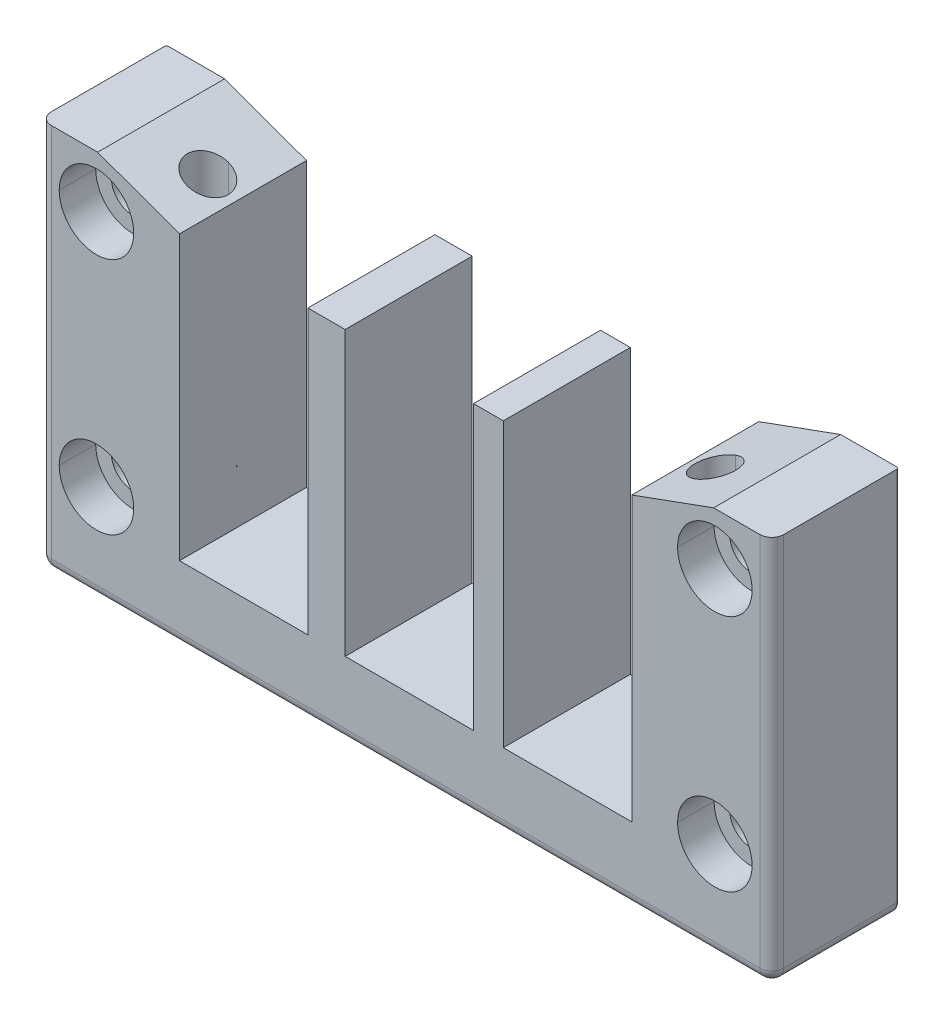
ISO-10303-21;
HEADER;
FILE_DESCRIPTION(('STEP AP214'),'2;1');
FILE_NAME('part.step','',(''),(''),'','','');
FILE_SCHEMA(('AUTOMOTIVE_DESIGN { 1 0 10303 214 1 1 1 1 }'));
ENDSEC;
DATA;
#1=APPLICATION_CONTEXT('core data for automotive mechanical design processes');
#2=APPLICATION_PROTOCOL_DEFINITION('international standard','automotive_design',2000,#1);
#3=PRODUCT_CONTEXT('',#1,'mechanical');
#4=PRODUCT('Part','Part','',(#3));
#5=PRODUCT_RELATED_PRODUCT_CATEGORY('part','',(#4));
#6=PRODUCT_DEFINITION_FORMATION('','',#4);
#7=PRODUCT_DEFINITION_CONTEXT('part definition',#1,'design');
#8=PRODUCT_DEFINITION('design','',#6,#7);
#9=PRODUCT_DEFINITION_SHAPE('','',#8);
#10=(LENGTH_UNIT() NAMED_UNIT(*) SI_UNIT(.MILLI.,.METRE.));
#11=(NAMED_UNIT(*) PLANE_ANGLE_UNIT() SI_UNIT($,.RADIAN.));
#12=(NAMED_UNIT(*) SI_UNIT($,.STERADIAN.) SOLID_ANGLE_UNIT());
#13=UNCERTAINTY_MEASURE_WITH_UNIT(LENGTH_MEASURE(1.E-05),#10,'distance_accuracy_value','');
#14=(GEOMETRIC_REPRESENTATION_CONTEXT(3) GLOBAL_UNCERTAINTY_ASSIGNED_CONTEXT((#13)) GLOBAL_UNIT_ASSIGNED_CONTEXT((#10,
#11,#12)) REPRESENTATION_CONTEXT('',''));
#15=CARTESIAN_POINT('',(0.,0.,0.));
#16=DIRECTION('',(0.,0.,1.));
#17=DIRECTION('',(1.,0.,0.));
#18=AXIS2_PLACEMENT_3D('',#15,#16,#17);
#19=CARTESIAN_POINT('',(36.4171361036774,-22.,-3.075));
#20=DIRECTION('',(0.866025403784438,0.,-0.5));
#21=DIRECTION('',(0.,-1.,0.));
#22=AXIS2_PLACEMENT_3D('',#19,#20,#21);
#23=PLANE('',#22);
#24=DIRECTION('',(0.5,0.,0.866025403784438));
#25=VECTOR('',#24,1.);
#26=CARTESIAN_POINT('',(36.4171361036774,-29.,-3.075));
#27=LINE('',#26,#25);
#28=CARTESIAN_POINT('',(36.4171361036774,-29.,-3.075));
#29=VERTEX_POINT('',#28);
#30=CARTESIAN_POINT('',(38.7842722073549,-29.,1.02499999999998));
#31=VERTEX_POINT('',#30);
#32=EDGE_CURVE('E508',#29,#31,#27,.T.);
#33=ORIENTED_EDGE('',*,*,#32,.T.);
#34=DIRECTION('',(0.,-1.,0.));
#35=VECTOR('',#34,1.);
#36=CARTESIAN_POINT('',(38.7842722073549,-22.,1.02499999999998));
#37=LINE('',#36,#35);
#38=CARTESIAN_POINT('',(38.7842722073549,-22.,1.02499999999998));
#39=VERTEX_POINT('',#38);
#40=EDGE_CURVE('E11',#39,#31,#37,.T.);
#41=ORIENTED_EDGE('',*,*,#40,.F.);
#42=DIRECTION('',(0.5,0.,0.866025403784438));
#43=VECTOR('',#42,1.);
#44=CARTESIAN_POINT('',(36.4171361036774,-22.,-3.075));
#45=LINE('',#44,#43);
#46=CARTESIAN_POINT('',(36.4171361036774,-22.,-3.075));
#47=VERTEX_POINT('',#46);
#48=EDGE_CURVE('E505',#47,#39,#45,.T.);
#49=ORIENTED_EDGE('',*,*,#48,.F.);
#50=DIRECTION('',(0.,-1.,0.));
#51=VECTOR('',#50,1.);
#52=CARTESIAN_POINT('',(36.4171361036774,-22.,-3.075));
#53=LINE('',#52,#51);
#54=EDGE_CURVE('E497',#47,#29,#53,.T.);
#55=ORIENTED_EDGE('',*,*,#54,.T.);
#56=EDGE_LOOP('',(#33,#41,#49,#55));
#57=FACE_BOUND('',#56,.T.);
#58=ADVANCED_FACE('F16',(#57),#23,.F.);
#59=CARTESIAN_POINT('',(38.7842722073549,-22.,1.02499999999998));
#60=DIRECTION('',(0.866025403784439,0.,0.5));
#61=DIRECTION('',(0.,-1.,0.));
#62=AXIS2_PLACEMENT_3D('',#59,#60,#61);
#63=PLANE('',#62);
#64=DIRECTION('',(-0.5,0.,0.866025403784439));
#65=VECTOR('',#64,1.);
#66=CARTESIAN_POINT('',(38.7842722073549,-29.,1.02499999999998));
#67=LINE('',#66,#65);
#68=CARTESIAN_POINT('',(36.4171361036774,-29.,5.125));
#69=VERTEX_POINT('',#68);
#70=EDGE_CURVE('E556',#31,#69,#67,.T.);
#71=ORIENTED_EDGE('',*,*,#70,.T.);
#72=DIRECTION('',(0.,-1.,0.));
#73=VECTOR('',#72,1.);
#74=CARTESIAN_POINT('',(36.4171361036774,-22.,5.125));
#75=LINE('',#74,#73);
#76=CARTESIAN_POINT('',(36.4171361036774,-22.,5.125));
#77=VERTEX_POINT('',#76);
#78=EDGE_CURVE('E25',#77,#69,#75,.T.);
#79=ORIENTED_EDGE('',*,*,#78,.F.);
#80=DIRECTION('',(-0.5,0.,0.866025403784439));
#81=VECTOR('',#80,1.);
#82=CARTESIAN_POINT('',(38.7842722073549,-22.,1.02499999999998));
#83=LINE('',#82,#81);
#84=EDGE_CURVE('E513',#39,#77,#83,.T.);
#85=ORIENTED_EDGE('',*,*,#84,.F.);
#86=ORIENTED_EDGE('',*,*,#40,.T.);
#87=EDGE_LOOP('',(#71,#79,#85,#86));
#88=FACE_BOUND('',#87,.T.);
#89=ADVANCED_FACE('F514',(#88),#63,.F.);
#90=CARTESIAN_POINT('',(36.4171361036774,-22.,5.125));
#91=DIRECTION('',(0.,0.,1.));
#92=DIRECTION('',(1.,0.,0.));
#93=AXIS2_PLACEMENT_3D('',#90,#91,#92);
#94=PLANE('',#93);
#95=DIRECTION('',(-1.,0.,0.));
#96=VECTOR('',#95,1.);
#97=CARTESIAN_POINT('',(36.4171361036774,-29.,5.125));
#98=LINE('',#97,#96);
#99=CARTESIAN_POINT('',(31.6828638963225,-29.,5.125));
#100=VERTEX_POINT('',#99);
#101=EDGE_CURVE('E554',#69,#100,#98,.T.);
#102=ORIENTED_EDGE('',*,*,#101,.T.);
#103=DIRECTION('',(0.,-1.,0.));
#104=VECTOR('',#103,1.);
#105=CARTESIAN_POINT('',(31.6828638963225,-22.,5.125));
#106=LINE('',#105,#104);
#107=CARTESIAN_POINT('',(31.6828638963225,-22.,5.125));
#108=VERTEX_POINT('',#107);
#109=EDGE_CURVE('E546',#108,#100,#106,.T.);
#110=ORIENTED_EDGE('',*,*,#109,.F.);
#111=DIRECTION('',(-1.,0.,0.));
#112=VECTOR('',#111,1.);
#113=CARTESIAN_POINT('',(36.4171361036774,-22.,5.125));
#114=LINE('',#113,#112);
#115=EDGE_CURVE('E519',#77,#108,#114,.T.);
#116=ORIENTED_EDGE('',*,*,#115,.F.);
#117=ORIENTED_EDGE('',*,*,#78,.T.);
#118=EDGE_LOOP('',(#102,#110,#116,#117));
#119=FACE_BOUND('',#118,.T.);
#120=ADVANCED_FACE('F552',(#119),#94,.F.);
#121=CARTESIAN_POINT('',(31.6828638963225,-22.,5.125));
#122=DIRECTION('',(-0.866025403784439,0.,0.5));
#123=DIRECTION('',(0.,1.,0.));
#124=AXIS2_PLACEMENT_3D('',#121,#122,#123);
#125=PLANE('',#124);
#126=DIRECTION('',(-0.5,0.,-0.866025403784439));
#127=VECTOR('',#126,1.);
#128=CARTESIAN_POINT('',(31.6828638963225,-29.,5.125));
#129=LINE('',#128,#127);
#130=CARTESIAN_POINT('',(29.315727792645,-29.,1.02499999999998));
#131=VERTEX_POINT('',#130);
#132=EDGE_CURVE('E564',#100,#131,#129,.T.);
#133=ORIENTED_EDGE('',*,*,#132,.T.);
#134=DIRECTION('',(0.,-1.,0.));
#135=VECTOR('',#134,1.);
#136=CARTESIAN_POINT('',(29.315727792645,-22.,1.02499999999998));
#137=LINE('',#136,#135);
#138=CARTESIAN_POINT('',(29.315727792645,-22.,1.02499999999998));
#139=VERTEX_POINT('',#138);
#140=EDGE_CURVE('E38',#139,#131,#137,.T.);
#141=ORIENTED_EDGE('',*,*,#140,.F.);
#142=DIRECTION('',(-0.5,0.,-0.866025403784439));
#143=VECTOR('',#142,1.);
#144=CARTESIAN_POINT('',(31.6828638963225,-22.,5.125));
#145=LINE('',#144,#143);
#146=EDGE_CURVE('E534',#108,#139,#145,.T.);
#147=ORIENTED_EDGE('',*,*,#146,.F.);
#148=ORIENTED_EDGE('',*,*,#109,.T.);
#149=EDGE_LOOP('',(#133,#141,#147,#148));
#150=FACE_BOUND('',#149,.T.);
#151=ADVANCED_FACE('F1127',(#150),#125,.F.);
#152=CARTESIAN_POINT('',(29.315727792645,-22.,1.02499999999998));
#153=DIRECTION('',(-0.866025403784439,0.,-0.5));
#154=DIRECTION('',(-0.5,0.,0.866025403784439));
#155=AXIS2_PLACEMENT_3D('',#152,#153,#154);
#156=PLANE('',#155);
#157=DIRECTION('',(0.5,0.,-0.866025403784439));
#158=VECTOR('',#157,1.);
#159=CARTESIAN_POINT('',(29.315727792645,-29.,1.02499999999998));
#160=LINE('',#159,#158);
#161=CARTESIAN_POINT('',(31.6828638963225,-29.,-3.075));
#162=VERTEX_POINT('',#161);
#163=EDGE_CURVE('E571',#131,#162,#160,.T.);
#164=ORIENTED_EDGE('',*,*,#163,.T.);
#165=DIRECTION('',(0.,-1.,0.));
#166=VECTOR('',#165,1.);
#167=CARTESIAN_POINT('',(31.6828638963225,-22.,-3.075));
#168=LINE('',#167,#166);
#169=CARTESIAN_POINT('',(31.6828638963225,-22.,-3.075));
#170=VERTEX_POINT('',#169);
#171=EDGE_CURVE('E541',#170,#162,#168,.T.);
#172=ORIENTED_EDGE('',*,*,#171,.F.);
#173=DIRECTION('',(0.5,0.,-0.866025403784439));
#174=VECTOR('',#173,1.);
#175=CARTESIAN_POINT('',(29.315727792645,-22.,1.02499999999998));
#176=LINE('',#175,#174);
#177=EDGE_CURVE('E538',#139,#170,#176,.T.);
#178=ORIENTED_EDGE('',*,*,#177,.F.);
#179=ORIENTED_EDGE('',*,*,#140,.T.);
#180=EDGE_LOOP('',(#164,#172,#178,#179));
#181=FACE_BOUND('',#180,.T.);
#182=ADVANCED_FACE('F1164',(#181),#156,.F.);
#183=CARTESIAN_POINT('',(31.6828638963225,-22.,-3.075));
#184=DIRECTION('',(0.,0.,-1.));
#185=DIRECTION('',(-1.,0.,0.));
#186=AXIS2_PLACEMENT_3D('',#183,#184,#185);
#187=PLANE('',#186);
#188=DIRECTION('',(1.,0.,0.));
#189=VECTOR('',#188,1.);
#190=CARTESIAN_POINT('',(31.6828638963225,-29.,-3.075));
#191=LINE('',#190,#189);
#192=EDGE_CURVE('E772',#162,#29,#191,.T.);
#193=ORIENTED_EDGE('',*,*,#192,.T.);
#194=ORIENTED_EDGE('',*,*,#54,.F.);
#195=DIRECTION('',(1.,0.,0.));
#196=VECTOR('',#195,1.);
#197=CARTESIAN_POINT('',(31.6828638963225,-22.,-3.075));
#198=LINE('',#197,#196);
#199=EDGE_CURVE('E523',#170,#47,#198,.T.);
#200=ORIENTED_EDGE('',*,*,#199,.F.);
#201=ORIENTED_EDGE('',*,*,#171,.T.);
#202=EDGE_LOOP('',(#193,#194,#200,#201));
#203=FACE_BOUND('',#202,.T.);
#204=ADVANCED_FACE('F1160',(#203),#187,.F.);
#205=CARTESIAN_POINT('',(0.,-22.,0.));
#206=DIRECTION('',(0.,-1.,0.));
#207=DIRECTION('',(0.,0.,-1.));
#208=AXIS2_PLACEMENT_3D('',#205,#206,#207);
#209=PLANE('',#208);
#210=CARTESIAN_POINT('',(34.05,-22.,1.025));
#211=DIRECTION('',(0.,1.,0.));
#212=DIRECTION('',(0.,0.,-1.));
#213=AXIS2_PLACEMENT_3D('',#210,#211,#212);
#214=CIRCLE('',#213,2.75);
#215=CARTESIAN_POINT('',(34.05,-22.,3.775));
#216=VERTEX_POINT('',#215);
#217=CARTESIAN_POINT('',(34.05,-22.,-1.725));
#218=VERTEX_POINT('',#217);
#219=EDGE_CURVE('E718',#216,#218,#214,.T.);
#220=ORIENTED_EDGE('',*,*,#219,.T.);
#221=CARTESIAN_POINT('',(34.05,-22.,1.025));
#222=DIRECTION('',(0.,1.,0.));
#223=DIRECTION('',(0.,0.,-1.));
#224=AXIS2_PLACEMENT_3D('',#221,#222,#223);
#225=CIRCLE('',#224,2.75);
#226=EDGE_CURVE('E675',#218,#216,#225,.T.);
#227=ORIENTED_EDGE('',*,*,#226,.T.);
#228=EDGE_LOOP('',(#220,#227));
#229=FACE_BOUND('',#228,.T.);
#230=ORIENTED_EDGE('',*,*,#199,.T.);
#231=ORIENTED_EDGE('',*,*,#48,.T.);
#232=ORIENTED_EDGE('',*,*,#84,.T.);
#233=ORIENTED_EDGE('',*,*,#115,.T.);
#234=ORIENTED_EDGE('',*,*,#146,.T.);
#235=ORIENTED_EDGE('',*,*,#177,.T.);
#236=EDGE_LOOP('',(#230,#231,#232,#233,#234,#235));
#237=FACE_BOUND('',#236,.T.);
#238=ADVANCED_FACE('F521',(#229,#237),#209,.T.);
#239=CARTESIAN_POINT('',(-31.6828638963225,-22.,-3.075));
#240=DIRECTION('',(0.866025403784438,0.,-0.5));
#241=DIRECTION('',(0.,-1.,0.));
#242=AXIS2_PLACEMENT_3D('',#239,#240,#241);
#243=PLANE('',#242);
#244=DIRECTION('',(0.5,0.,0.866025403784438));
#245=VECTOR('',#244,1.);
#246=CARTESIAN_POINT('',(-31.6828638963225,-29.,-3.075));
#247=LINE('',#246,#245);
#248=CARTESIAN_POINT('',(-31.6828638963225,-29.,-3.075));
#249=VERTEX_POINT('',#248);
#250=CARTESIAN_POINT('',(-29.315727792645,-29.,1.025));
#251=VERTEX_POINT('',#250);
#252=EDGE_CURVE('E559',#249,#251,#247,.T.);
#253=ORIENTED_EDGE('',*,*,#252,.T.);
#254=DIRECTION('',(0.,-1.,0.));
#255=VECTOR('',#254,1.);
#256=CARTESIAN_POINT('',(-29.315727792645,-22.,1.025));
#257=LINE('',#256,#255);
#258=CARTESIAN_POINT('',(-29.315727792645,-22.,1.025));
#259=VERTEX_POINT('',#258);
#260=EDGE_CURVE('E528',#259,#251,#257,.T.);
#261=ORIENTED_EDGE('',*,*,#260,.F.);
#262=DIRECTION('',(0.5,0.,0.866025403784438));
#263=VECTOR('',#262,1.);
#264=CARTESIAN_POINT('',(-31.6828638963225,-22.,-3.075));
#265=LINE('',#264,#263);
#266=CARTESIAN_POINT('',(-31.6828638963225,-22.,-3.075));
#267=VERTEX_POINT('',#266);
#268=EDGE_CURVE('E1038',#267,#259,#265,.T.);
#269=ORIENTED_EDGE('',*,*,#268,.F.);
#270=DIRECTION('',(0.,-1.,0.));
#271=VECTOR('',#270,1.);
#272=CARTESIAN_POINT('',(-31.6828638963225,-22.,-3.075));
#273=LINE('',#272,#271);
#274=EDGE_CURVE('E1058',#267,#249,#273,.T.);
#275=ORIENTED_EDGE('',*,*,#274,.T.);
#276=EDGE_LOOP('',(#253,#261,#269,#275));
#277=FACE_BOUND('',#276,.T.);
#278=ADVANCED_FACE('F1086',(#277),#243,.F.);
#279=CARTESIAN_POINT('',(-29.315727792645,-22.,1.025));
#280=DIRECTION('',(0.866025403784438,0.,0.5));
#281=DIRECTION('',(0.,-1.,0.));
#282=AXIS2_PLACEMENT_3D('',#279,#280,#281);
#283=PLANE('',#282);
#284=DIRECTION('',(-0.5,0.,0.866025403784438));
#285=VECTOR('',#284,1.);
#286=CARTESIAN_POINT('',(-29.315727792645,-29.,1.025));
#287=LINE('',#286,#285);
#288=CARTESIAN_POINT('',(-31.6828638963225,-29.,5.125));
#289=VERTEX_POINT('',#288);
#290=EDGE_CURVE('E618',#251,#289,#287,.T.);
#291=ORIENTED_EDGE('',*,*,#290,.T.);
#292=DIRECTION('',(0.,-1.,0.));
#293=VECTOR('',#292,1.);
#294=CARTESIAN_POINT('',(-31.6828638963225,-22.,5.125));
#295=LINE('',#294,#293);
#296=CARTESIAN_POINT('',(-31.6828638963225,-22.,5.125));
#297=VERTEX_POINT('',#296);
#298=EDGE_CURVE('E1068',#297,#289,#295,.T.);
#299=ORIENTED_EDGE('',*,*,#298,.F.);
#300=DIRECTION('',(-0.5,0.,0.866025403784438));
#301=VECTOR('',#300,1.);
#302=CARTESIAN_POINT('',(-29.315727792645,-22.,1.025));
#303=LINE('',#302,#301);
#304=EDGE_CURVE('E1042',#259,#297,#303,.T.);
#305=ORIENTED_EDGE('',*,*,#304,.F.);
#306=ORIENTED_EDGE('',*,*,#260,.T.);
#307=EDGE_LOOP('',(#291,#299,#305,#306));
#308=FACE_BOUND('',#307,.T.);
#309=ADVANCED_FACE('F1076',(#308),#283,.F.);
#310=CARTESIAN_POINT('',(-31.6828638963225,-22.,5.125));
#311=DIRECTION('',(0.,0.,1.));
#312=DIRECTION('',(1.,0.,0.));
#313=AXIS2_PLACEMENT_3D('',#310,#311,#312);
#314=PLANE('',#313);
#315=DIRECTION('',(-1.,0.,0.));
#316=VECTOR('',#315,1.);
#317=CARTESIAN_POINT('',(-31.6828638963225,-29.,5.125));
#318=LINE('',#317,#316);
#319=CARTESIAN_POINT('',(-36.4171361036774,-29.,5.125));
#320=VERTEX_POINT('',#319);
#321=EDGE_CURVE('E614',#289,#320,#318,.T.);
#322=ORIENTED_EDGE('',*,*,#321,.T.);
#323=DIRECTION('',(0.,-1.,0.));
#324=VECTOR('',#323,1.);
#325=CARTESIAN_POINT('',(-36.4171361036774,-22.,5.125));
#326=LINE('',#325,#324);
#327=CARTESIAN_POINT('',(-36.4171361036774,-22.,5.125));
#328=VERTEX_POINT('',#327);
#329=EDGE_CURVE('E1067',#328,#320,#326,.T.);
#330=ORIENTED_EDGE('',*,*,#329,.F.);
#331=DIRECTION('',(-1.,0.,0.));
#332=VECTOR('',#331,1.);
#333=CARTESIAN_POINT('',(-31.6828638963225,-22.,5.125));
#334=LINE('',#333,#332);
#335=EDGE_CURVE('E1046',#297,#328,#334,.T.);
#336=ORIENTED_EDGE('',*,*,#335,.F.);
#337=ORIENTED_EDGE('',*,*,#298,.T.);
#338=EDGE_LOOP('',(#322,#330,#336,#337));
#339=FACE_BOUND('',#338,.T.);
#340=ADVANCED_FACE('F1101',(#339),#314,.F.);
#341=CARTESIAN_POINT('',(-36.4171361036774,-22.,5.125));
#342=DIRECTION('',(-0.866025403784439,0.,0.5));
#343=DIRECTION('',(0.,1.,0.));
#344=AXIS2_PLACEMENT_3D('',#341,#342,#343);
#345=PLANE('',#344);
#346=DIRECTION('',(-0.5,0.,-0.866025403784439));
#347=VECTOR('',#346,1.);
#348=CARTESIAN_POINT('',(-36.4171361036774,-29.,5.125));
#349=LINE('',#348,#347);
#350=CARTESIAN_POINT('',(-38.7842722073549,-29.,1.025));
#351=VERTEX_POINT('',#350);
#352=EDGE_CURVE('E619',#320,#351,#349,.T.);
#353=ORIENTED_EDGE('',*,*,#352,.T.);
#354=DIRECTION('',(0.,-1.,0.));
#355=VECTOR('',#354,1.);
#356=CARTESIAN_POINT('',(-38.7842722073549,-22.,1.025));
#357=LINE('',#356,#355);
#358=CARTESIAN_POINT('',(-38.7842722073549,-22.,1.025));
#359=VERTEX_POINT('',#358);
#360=EDGE_CURVE('E1064',#359,#351,#357,.T.);
#361=ORIENTED_EDGE('',*,*,#360,.F.);
#362=DIRECTION('',(-0.5,0.,-0.866025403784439));
#363=VECTOR('',#362,1.);
#364=CARTESIAN_POINT('',(-36.4171361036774,-22.,5.125));
#365=LINE('',#364,#363);
#366=EDGE_CURVE('E1050',#328,#359,#365,.T.);
#367=ORIENTED_EDGE('',*,*,#366,.F.);
#368=ORIENTED_EDGE('',*,*,#329,.T.);
#369=EDGE_LOOP('',(#353,#361,#367,#368));
#370=FACE_BOUND('',#369,.T.);
#371=ADVANCED_FACE('F1096',(#370),#345,.F.);
#372=CARTESIAN_POINT('',(-38.7842722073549,-22.,1.025));
#373=DIRECTION('',(-0.866025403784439,0.,-0.5));
#374=DIRECTION('',(-0.5,0.,0.866025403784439));
#375=AXIS2_PLACEMENT_3D('',#372,#373,#374);
#376=PLANE('',#375);
#377=DIRECTION('',(0.5,0.,-0.866025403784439));
#378=VECTOR('',#377,1.);
#379=CARTESIAN_POINT('',(-38.7842722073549,-29.,1.025));
#380=LINE('',#379,#378);
#381=CARTESIAN_POINT('',(-36.4171361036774,-29.,-3.075));
#382=VERTEX_POINT('',#381);
#383=EDGE_CURVE('E782',#351,#382,#380,.T.);
#384=ORIENTED_EDGE('',*,*,#383,.T.);
#385=DIRECTION('',(0.,-1.,0.));
#386=VECTOR('',#385,1.);
#387=CARTESIAN_POINT('',(-36.4171361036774,-22.,-3.075));
#388=LINE('',#387,#386);
#389=CARTESIAN_POINT('',(-36.4171361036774,-22.,-3.075));
#390=VERTEX_POINT('',#389);
#391=EDGE_CURVE('E1061',#390,#382,#388,.T.);
#392=ORIENTED_EDGE('',*,*,#391,.F.);
#393=DIRECTION('',(0.5,0.,-0.866025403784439));
#394=VECTOR('',#393,1.);
#395=CARTESIAN_POINT('',(-38.7842722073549,-22.,1.025));
#396=LINE('',#395,#394);
#397=EDGE_CURVE('E1054',#359,#390,#396,.T.);
#398=ORIENTED_EDGE('',*,*,#397,.F.);
#399=ORIENTED_EDGE('',*,*,#360,.T.);
#400=EDGE_LOOP('',(#384,#392,#398,#399));
#401=FACE_BOUND('',#400,.T.);
#402=ADVANCED_FACE('F1092',(#401),#376,.F.);
#403=CARTESIAN_POINT('',(-36.4171361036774,-22.,-3.075));
#404=DIRECTION('',(0.,0.,-1.));
#405=DIRECTION('',(0.,-1.,0.));
#406=AXIS2_PLACEMENT_3D('',#403,#404,#405);
#407=PLANE('',#406);
#408=DIRECTION('',(1.,0.,0.));
#409=VECTOR('',#408,1.);
#410=CARTESIAN_POINT('',(-36.4171361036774,-29.,-3.075));
#411=LINE('',#410,#409);
#412=EDGE_CURVE('E778',#382,#249,#411,.T.);
#413=ORIENTED_EDGE('',*,*,#412,.T.);
#414=ORIENTED_EDGE('',*,*,#274,.F.);
#415=DIRECTION('',(1.,0.,0.));
#416=VECTOR('',#415,1.);
#417=CARTESIAN_POINT('',(-36.4171361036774,-22.,-3.075));
#418=LINE('',#417,#416);
#419=EDGE_CURVE('E1034',#390,#267,#418,.T.);
#420=ORIENTED_EDGE('',*,*,#419,.F.);
#421=ORIENTED_EDGE('',*,*,#391,.T.);
#422=EDGE_LOOP('',(#413,#414,#420,#421));
#423=FACE_BOUND('',#422,.T.);
#424=ADVANCED_FACE('F1089',(#423),#407,.F.);
#425=CARTESIAN_POINT('',(0.,-22.,0.));
#426=DIRECTION('',(0.,-1.,0.));
#427=DIRECTION('',(0.,0.,-1.));
#428=AXIS2_PLACEMENT_3D('',#425,#426,#427);
#429=PLANE('',#428);
#430=CARTESIAN_POINT('',(-34.05,-22.,1.025));
#431=DIRECTION('',(0.,1.,0.));
#432=DIRECTION('',(0.,0.,-1.));
#433=AXIS2_PLACEMENT_3D('',#430,#431,#432);
#434=CIRCLE('',#433,2.75);
#435=CARTESIAN_POINT('',(-34.05,-22.,3.775));
#436=VERTEX_POINT('',#435);
#437=CARTESIAN_POINT('',(-34.05,-22.,-1.725));
#438=VERTEX_POINT('',#437);
#439=EDGE_CURVE('E732',#436,#438,#434,.T.);
#440=ORIENTED_EDGE('',*,*,#439,.T.);
#441=CARTESIAN_POINT('',(-34.05,-22.,1.025));
#442=DIRECTION('',(0.,1.,0.));
#443=DIRECTION('',(0.,0.,-1.));
#444=AXIS2_PLACEMENT_3D('',#441,#442,#443);
#445=CIRCLE('',#444,2.75);
#446=EDGE_CURVE('E637',#438,#436,#445,.T.);
#447=ORIENTED_EDGE('',*,*,#446,.T.);
#448=EDGE_LOOP('',(#440,#447));
#449=FACE_BOUND('',#448,.T.);
#450=ORIENTED_EDGE('',*,*,#419,.T.);
#451=ORIENTED_EDGE('',*,*,#268,.T.);
#452=ORIENTED_EDGE('',*,*,#304,.T.);
#453=ORIENTED_EDGE('',*,*,#335,.T.);
#454=ORIENTED_EDGE('',*,*,#366,.T.);
#455=ORIENTED_EDGE('',*,*,#397,.T.);
#456=EDGE_LOOP('',(#450,#451,#452,#453,#454,#455));
#457=FACE_BOUND('',#456,.T.);
#458=ADVANCED_FACE('F1103',(#449,#457),#429,.T.);
#459=CARTESIAN_POINT('',(-41.5,16.,8.525));
#460=DIRECTION('',(0.,0.,1.));
#461=DIRECTION('',(1.,0.,0.));
#462=AXIS2_PLACEMENT_3D('',#459,#460,#461);
#463=CYLINDRICAL_SURFACE('',#462,5.);
#464=DIRECTION('',(0.,0.,1.));
#465=VECTOR('',#464,1.);
#466=CARTESIAN_POINT('',(-46.5,16.,8.525));
#467=LINE('',#466,#465);
#468=CARTESIAN_POINT('',(-46.5,16.,3.625));
#469=VERTEX_POINT('',#468);
#470=CARTESIAN_POINT('',(-46.5,16.,8.525));
#471=VERTEX_POINT('',#470);
#472=EDGE_CURVE('E1299',#469,#471,#467,.T.);
#473=ORIENTED_EDGE('',*,*,#472,.F.);
#474=CARTESIAN_POINT('',(-41.5,16.,3.625));
#475=DIRECTION('',(0.,0.,1.));
#476=DIRECTION('',(1.,0.,0.));
#477=AXIS2_PLACEMENT_3D('',#474,#475,#476);
#478=CIRCLE('',#477,5.);
#479=CARTESIAN_POINT('',(-36.5,16.,3.625));
#480=VERTEX_POINT('',#479);
#481=EDGE_CURVE('E1030',#480,#469,#478,.T.);
#482=ORIENTED_EDGE('',*,*,#481,.F.);
#483=DIRECTION('',(0.,0.,1.));
#484=VECTOR('',#483,1.);
#485=CARTESIAN_POINT('',(-36.5,16.,8.525));
#486=LINE('',#485,#484);
#487=CARTESIAN_POINT('',(-36.5,16.,8.525));
#488=VERTEX_POINT('',#487);
#489=EDGE_CURVE('E1287',#480,#488,#486,.T.);
#490=ORIENTED_EDGE('',*,*,#489,.T.);
#491=CARTESIAN_POINT('',(-41.5,16.,8.525));
#492=DIRECTION('',(0.,0.,1.));
#493=DIRECTION('',(1.,0.,0.));
#494=AXIS2_PLACEMENT_3D('',#491,#492,#493);
#495=CIRCLE('',#494,5.);
#496=EDGE_CURVE('E983',#488,#471,#495,.T.);
#497=ORIENTED_EDGE('',*,*,#496,.T.);
#498=EDGE_LOOP('',(#473,#482,#490,#497));
#499=FACE_BOUND('',#498,.T.);
#500=ADVANCED_FACE('F1105',(#499),#463,.F.);
#501=CARTESIAN_POINT('',(-38.6,16.,3.625));
#502=DIRECTION('',(0.,0.,-1.));
#503=DIRECTION('',(0.,-1.,0.));
#504=AXIS2_PLACEMENT_3D('',#501,#502,#503);
#505=PLANE('',#504);
#506=CARTESIAN_POINT('',(-41.5,16.,3.625));
#507=DIRECTION('',(0.,0.,1.));
#508=DIRECTION('',(1.,0.,0.));
#509=AXIS2_PLACEMENT_3D('',#506,#507,#508);
#510=CIRCLE('',#509,2.9);
#511=CARTESIAN_POINT('',(-38.6,16.,3.625));
#512=VERTEX_POINT('',#511);
#513=CARTESIAN_POINT('',(-44.4,16.,3.625));
#514=VERTEX_POINT('',#513);
#515=EDGE_CURVE('E1027',#512,#514,#510,.T.);
#516=ORIENTED_EDGE('',*,*,#515,.F.);
#517=CARTESIAN_POINT('',(-41.5,16.,3.625));
#518=DIRECTION('',(0.,0.,1.));
#519=DIRECTION('',(1.,0.,0.));
#520=AXIS2_PLACEMENT_3D('',#517,#518,#519);
#521=CIRCLE('',#520,2.9);
#522=EDGE_CURVE('E1256',#514,#512,#521,.T.);
#523=ORIENTED_EDGE('',*,*,#522,.F.);
#524=EDGE_LOOP('',(#516,#523));
#525=FACE_BOUND('',#524,.T.);
#526=ORIENTED_EDGE('',*,*,#481,.T.);
#527=CARTESIAN_POINT('',(-41.5,16.,3.625));
#528=DIRECTION('',(0.,0.,1.));
#529=DIRECTION('',(1.,0.,0.));
#530=AXIS2_PLACEMENT_3D('',#527,#528,#529);
#531=CIRCLE('',#530,5.);
#532=EDGE_CURVE('E1311',#469,#480,#531,.T.);
#533=ORIENTED_EDGE('',*,*,#532,.T.);
#534=EDGE_LOOP('',(#526,#533));
#535=FACE_BOUND('',#534,.T.);
#536=ADVANCED_FACE('F1113',(#525,#535),#505,.F.);
#537=CARTESIAN_POINT('',(-41.5,16.,8.525));
#538=DIRECTION('',(0.,0.,1.));
#539=DIRECTION('',(1.,0.,0.));
#540=AXIS2_PLACEMENT_3D('',#537,#538,#539);
#541=CYLINDRICAL_SURFACE('',#540,2.9);
#542=DIRECTION('',(0.,0.,1.));
#543=VECTOR('',#542,1.);
#544=CARTESIAN_POINT('',(-44.4,16.,8.525));
#545=LINE('',#544,#543);
#546=CARTESIAN_POINT('',(-44.4,16.,-8.525));
#547=VERTEX_POINT('',#546);
#548=EDGE_CURVE('E1274',#547,#514,#545,.T.);
#549=ORIENTED_EDGE('',*,*,#548,.F.);
#550=CARTESIAN_POINT('',(-41.5,16.,-8.525));
#551=DIRECTION('',(0.,0.,1.));
#552=DIRECTION('',(1.,0.,0.));
#553=AXIS2_PLACEMENT_3D('',#550,#551,#552);
#554=CIRCLE('',#553,2.9);
#555=CARTESIAN_POINT('',(-38.6,16.,-8.525));
#556=VERTEX_POINT('',#555);
#557=EDGE_CURVE('E659',#556,#547,#554,.T.);
#558=ORIENTED_EDGE('',*,*,#557,.F.);
#559=DIRECTION('',(0.,0.,1.));
#560=VECTOR('',#559,1.);
#561=CARTESIAN_POINT('',(-38.6,16.,8.525));
#562=LINE('',#561,#560);
#563=EDGE_CURVE('E1253',#556,#512,#562,.T.);
#564=ORIENTED_EDGE('',*,*,#563,.T.);
#565=ORIENTED_EDGE('',*,*,#515,.T.);
#566=EDGE_LOOP('',(#549,#558,#564,#565));
#567=FACE_BOUND('',#566,.T.);
#568=ADVANCED_FACE('F1147',(#567),#541,.F.);
#569=CARTESIAN_POINT('',(-41.5,-16.,8.525));
#570=DIRECTION('',(0.,0.,1.));
#571=DIRECTION('',(1.,0.,0.));
#572=AXIS2_PLACEMENT_3D('',#569,#570,#571);
#573=CYLINDRICAL_SURFACE('',#572,5.);
#574=DIRECTION('',(0.,0.,1.));
#575=VECTOR('',#574,1.);
#576=CARTESIAN_POINT('',(-46.5,-16.,8.525));
#577=LINE('',#576,#575);
#578=CARTESIAN_POINT('',(-46.5,-16.,3.625));
#579=VERTEX_POINT('',#578);
#580=CARTESIAN_POINT('',(-46.5,-16.,8.525));
#581=VERTEX_POINT('',#580);
#582=EDGE_CURVE('E1252',#579,#581,#577,.T.);
#583=ORIENTED_EDGE('',*,*,#582,.F.);
#584=CARTESIAN_POINT('',(-41.5,-16.,3.625));
#585=DIRECTION('',(0.,0.,1.));
#586=DIRECTION('',(1.,0.,0.));
#587=AXIS2_PLACEMENT_3D('',#584,#585,#586);
#588=CIRCLE('',#587,5.);
#589=CARTESIAN_POINT('',(-36.5,-16.,3.625));
#590=VERTEX_POINT('',#589);
#591=EDGE_CURVE('E1024',#590,#579,#588,.T.);
#592=ORIENTED_EDGE('',*,*,#591,.F.);
#593=DIRECTION('',(0.,0.,1.));
#594=VECTOR('',#593,1.);
#595=CARTESIAN_POINT('',(-36.5,-16.,8.525));
#596=LINE('',#595,#594);
#597=CARTESIAN_POINT('',(-36.5,-16.,8.525));
#598=VERTEX_POINT('',#597);
#599=EDGE_CURVE('E1240',#590,#598,#596,.T.);
#600=ORIENTED_EDGE('',*,*,#599,.T.);
#601=CARTESIAN_POINT('',(-41.5,-16.,8.525));
#602=DIRECTION('',(0.,0.,1.));
#603=DIRECTION('',(1.,0.,0.));
#604=AXIS2_PLACEMENT_3D('',#601,#602,#603);
#605=CIRCLE('',#604,5.);
#606=EDGE_CURVE('E986',#598,#581,#605,.T.);
#607=ORIENTED_EDGE('',*,*,#606,.T.);
#608=EDGE_LOOP('',(#583,#592,#600,#607));
#609=FACE_BOUND('',#608,.T.);
#610=ADVANCED_FACE('F1143',(#609),#573,.F.);
#611=CARTESIAN_POINT('',(-38.6,-16.,3.625));
#612=DIRECTION('',(0.,0.,-1.));
#613=DIRECTION('',(0.,-1.,0.));
#614=AXIS2_PLACEMENT_3D('',#611,#612,#613);
#615=PLANE('',#614);
#616=CARTESIAN_POINT('',(-41.5,-16.,3.625));
#617=DIRECTION('',(0.,0.,1.));
#618=DIRECTION('',(1.,0.,0.));
#619=AXIS2_PLACEMENT_3D('',#616,#617,#618);
#620=CIRCLE('',#619,2.9);
#621=CARTESIAN_POINT('',(-38.6,-16.,3.625));
#622=VERTEX_POINT('',#621);
#623=CARTESIAN_POINT('',(-44.4,-16.,3.625));
#624=VERTEX_POINT('',#623);
#625=EDGE_CURVE('E1021',#622,#624,#620,.T.);
#626=ORIENTED_EDGE('',*,*,#625,.F.);
#627=CARTESIAN_POINT('',(-41.5,-16.,3.625));
#628=DIRECTION('',(0.,0.,1.));
#629=DIRECTION('',(1.,0.,0.));
#630=AXIS2_PLACEMENT_3D('',#627,#628,#629);
#631=CIRCLE('',#630,2.9);
#632=EDGE_CURVE('E1234',#624,#622,#631,.T.);
#633=ORIENTED_EDGE('',*,*,#632,.F.);
#634=EDGE_LOOP('',(#626,#633));
#635=FACE_BOUND('',#634,.T.);
#636=ORIENTED_EDGE('',*,*,#591,.T.);
#637=CARTESIAN_POINT('',(-41.5,-16.,3.625));
#638=DIRECTION('',(0.,0.,1.));
#639=DIRECTION('',(1.,0.,0.));
#640=AXIS2_PLACEMENT_3D('',#637,#638,#639);
#641=CIRCLE('',#640,5.);
#642=EDGE_CURVE('E1248',#579,#590,#641,.T.);
#643=ORIENTED_EDGE('',*,*,#642,.T.);
#644=EDGE_LOOP('',(#636,#643));
#645=FACE_BOUND('',#644,.T.);
#646=ADVANCED_FACE('F1139',(#635,#645),#615,.F.);
#647=CARTESIAN_POINT('',(-41.5,-16.,8.525));
#648=DIRECTION('',(0.,0.,1.));
#649=DIRECTION('',(1.,0.,0.));
#650=AXIS2_PLACEMENT_3D('',#647,#648,#649);
#651=CYLINDRICAL_SURFACE('',#650,2.9);
#652=DIRECTION('',(0.,0.,1.));
#653=VECTOR('',#652,1.);
#654=CARTESIAN_POINT('',(-44.4,-16.,8.525));
#655=LINE('',#654,#653);
#656=CARTESIAN_POINT('',(-44.4,-16.,-8.525));
#657=VERTEX_POINT('',#656);
#658=EDGE_CURVE('E1239',#657,#624,#655,.T.);
#659=ORIENTED_EDGE('',*,*,#658,.F.);
#660=CARTESIAN_POINT('',(-41.5,-16.,-8.525));
#661=DIRECTION('',(0.,0.,1.));
#662=DIRECTION('',(1.,0.,0.));
#663=AXIS2_PLACEMENT_3D('',#660,#661,#662);
#664=CIRCLE('',#663,2.9);
#665=CARTESIAN_POINT('',(-38.6,-16.,-8.525));
#666=VERTEX_POINT('',#665);
#667=EDGE_CURVE('E671',#666,#657,#664,.T.);
#668=ORIENTED_EDGE('',*,*,#667,.F.);
#669=DIRECTION('',(0.,0.,1.));
#670=VECTOR('',#669,1.);
#671=CARTESIAN_POINT('',(-38.6,-16.,8.525));
#672=LINE('',#671,#670);
#673=EDGE_CURVE('E1228',#666,#622,#672,.T.);
#674=ORIENTED_EDGE('',*,*,#673,.T.);
#675=ORIENTED_EDGE('',*,*,#625,.T.);
#676=EDGE_LOOP('',(#659,#668,#674,#675));
#677=FACE_BOUND('',#676,.T.);
#678=ADVANCED_FACE('F1135',(#677),#651,.F.);
#679=CARTESIAN_POINT('',(41.5,-16.,8.525));
#680=DIRECTION('',(0.,0.,1.));
#681=DIRECTION('',(1.,0.,0.));
#682=AXIS2_PLACEMENT_3D('',#679,#680,#681);
#683=CYLINDRICAL_SURFACE('',#682,5.);
#684=DIRECTION('',(0.,0.,1.));
#685=VECTOR('',#684,1.);
#686=CARTESIAN_POINT('',(36.5,-16.,8.525));
#687=LINE('',#686,#685);
#688=CARTESIAN_POINT('',(36.5,-16.,3.625));
#689=VERTEX_POINT('',#688);
#690=CARTESIAN_POINT('',(36.5,-16.,8.525));
#691=VERTEX_POINT('',#690);
#692=EDGE_CURVE('E1217',#689,#691,#687,.T.);
#693=ORIENTED_EDGE('',*,*,#692,.F.);
#694=CARTESIAN_POINT('',(41.5,-16.,3.625));
#695=DIRECTION('',(0.,0.,1.));
#696=DIRECTION('',(1.,0.,0.));
#697=AXIS2_PLACEMENT_3D('',#694,#695,#696);
#698=CIRCLE('',#697,5.);
#699=CARTESIAN_POINT('',(46.5,-16.,3.625));
#700=VERTEX_POINT('',#699);
#701=EDGE_CURVE('E1018',#700,#689,#698,.T.);
#702=ORIENTED_EDGE('',*,*,#701,.F.);
#703=DIRECTION('',(0.,0.,1.));
#704=VECTOR('',#703,1.);
#705=CARTESIAN_POINT('',(46.5,-16.,8.525));
#706=LINE('',#705,#704);
#707=CARTESIAN_POINT('',(46.5,-16.,8.525));
#708=VERTEX_POINT('',#707);
#709=EDGE_CURVE('E1205',#700,#708,#706,.T.);
#710=ORIENTED_EDGE('',*,*,#709,.T.);
#711=CARTESIAN_POINT('',(41.5,-16.,8.525));
#712=DIRECTION('',(0.,0.,1.));
#713=DIRECTION('',(1.,0.,0.));
#714=AXIS2_PLACEMENT_3D('',#711,#712,#713);
#715=CIRCLE('',#714,5.);
#716=EDGE_CURVE('E989',#708,#691,#715,.T.);
#717=ORIENTED_EDGE('',*,*,#716,.T.);
#718=EDGE_LOOP('',(#693,#702,#710,#717));
#719=FACE_BOUND('',#718,.T.);
#720=ADVANCED_FACE('F1132',(#719),#683,.F.);
#721=CARTESIAN_POINT('',(44.4,-16.,3.625));
#722=DIRECTION('',(0.,0.,-1.));
#723=DIRECTION('',(0.,-1.,0.));
#724=AXIS2_PLACEMENT_3D('',#721,#722,#723);
#725=PLANE('',#724);
#726=CARTESIAN_POINT('',(41.5,-16.,3.625));
#727=DIRECTION('',(0.,0.,1.));
#728=DIRECTION('',(1.,0.,0.));
#729=AXIS2_PLACEMENT_3D('',#726,#727,#728);
#730=CIRCLE('',#729,2.9);
#731=CARTESIAN_POINT('',(44.4,-16.,3.625));
#732=VERTEX_POINT('',#731);
#733=CARTESIAN_POINT('',(38.6,-16.,3.625));
#734=VERTEX_POINT('',#733);
#735=EDGE_CURVE('E1015',#732,#734,#730,.T.);
#736=ORIENTED_EDGE('',*,*,#735,.F.);
#737=CARTESIAN_POINT('',(41.5,-16.,3.625));
#738=DIRECTION('',(0.,0.,1.));
#739=DIRECTION('',(1.,0.,0.));
#740=AXIS2_PLACEMENT_3D('',#737,#738,#739);
#741=CIRCLE('',#740,2.9);
#742=EDGE_CURVE('E581',#734,#732,#741,.T.);
#743=ORIENTED_EDGE('',*,*,#742,.F.);
#744=EDGE_LOOP('',(#736,#743));
#745=FACE_BOUND('',#744,.T.);
#746=ORIENTED_EDGE('',*,*,#701,.T.);
#747=CARTESIAN_POINT('',(41.5,-16.,3.625));
#748=DIRECTION('',(0.,0.,1.));
#749=DIRECTION('',(1.,0.,0.));
#750=AXIS2_PLACEMENT_3D('',#747,#748,#749);
#751=CIRCLE('',#750,5.);
#752=EDGE_CURVE('E1224',#689,#700,#751,.T.);
#753=ORIENTED_EDGE('',*,*,#752,.T.);
#754=EDGE_LOOP('',(#746,#753));
#755=FACE_BOUND('',#754,.T.);
#756=ADVANCED_FACE('F1130',(#745,#755),#725,.F.);
#757=CARTESIAN_POINT('',(41.5,-16.,8.525));
#758=DIRECTION('',(0.,0.,1.));
#759=DIRECTION('',(1.,0.,0.));
#760=AXIS2_PLACEMENT_3D('',#757,#758,#759);
#761=CYLINDRICAL_SURFACE('',#760,2.9);
#762=DIRECTION('',(0.,0.,1.));
#763=VECTOR('',#762,1.);
#764=CARTESIAN_POINT('',(38.6,-16.,8.525));
#765=LINE('',#764,#763);
#766=CARTESIAN_POINT('',(38.6,-16.,-8.525));
#767=VERTEX_POINT('',#766);
#768=EDGE_CURVE('E1181',#767,#734,#765,.T.);
#769=ORIENTED_EDGE('',*,*,#768,.F.);
#770=CARTESIAN_POINT('',(41.5,-16.,-8.525));
#771=DIRECTION('',(0.,0.,1.));
#772=DIRECTION('',(1.,0.,0.));
#773=AXIS2_PLACEMENT_3D('',#770,#771,#772);
#774=CIRCLE('',#773,2.9);
#775=CARTESIAN_POINT('',(44.4,-16.,-8.525));
#776=VERTEX_POINT('',#775);
#777=EDGE_CURVE('E939',#776,#767,#774,.T.);
#778=ORIENTED_EDGE('',*,*,#777,.F.);
#779=DIRECTION('',(0.,0.,1.));
#780=VECTOR('',#779,1.);
#781=CARTESIAN_POINT('',(44.4,-16.,8.525));
#782=LINE('',#781,#780);
#783=EDGE_CURVE('E577',#776,#732,#782,.T.);
#784=ORIENTED_EDGE('',*,*,#783,.T.);
#785=ORIENTED_EDGE('',*,*,#735,.T.);
#786=EDGE_LOOP('',(#769,#778,#784,#785));
#787=FACE_BOUND('',#786,.T.);
#788=ADVANCED_FACE('F1200',(#787),#761,.F.);
#789=CARTESIAN_POINT('',(41.5,16.,8.525));
#790=DIRECTION('',(0.,0.,1.));
#791=DIRECTION('',(1.,0.,0.));
#792=AXIS2_PLACEMENT_3D('',#789,#790,#791);
#793=CYLINDRICAL_SURFACE('',#792,5.);
#794=DIRECTION('',(0.,0.,1.));
#795=VECTOR('',#794,1.);
#796=CARTESIAN_POINT('',(36.5,16.,8.525));
#797=LINE('',#796,#795);
#798=CARTESIAN_POINT('',(36.5,16.,3.625));
#799=VERTEX_POINT('',#798);
#800=CARTESIAN_POINT('',(36.5,16.,8.525));
#801=VERTEX_POINT('',#800);
#802=EDGE_CURVE('E591',#799,#801,#797,.T.);
#803=ORIENTED_EDGE('',*,*,#802,.F.);
#804=CARTESIAN_POINT('',(41.5,16.,3.625));
#805=DIRECTION('',(0.,0.,1.));
#806=DIRECTION('',(1.,0.,0.));
#807=AXIS2_PLACEMENT_3D('',#804,#805,#806);
#808=CIRCLE('',#807,5.);
#809=CARTESIAN_POINT('',(46.5,16.,3.625));
#810=VERTEX_POINT('',#809);
#811=EDGE_CURVE('E1012',#810,#799,#808,.T.);
#812=ORIENTED_EDGE('',*,*,#811,.F.);
#813=DIRECTION('',(0.,0.,1.));
#814=VECTOR('',#813,1.);
#815=CARTESIAN_POINT('',(46.5,16.,8.525));
#816=LINE('',#815,#814);
#817=CARTESIAN_POINT('',(46.5,16.,8.525));
#818=VERTEX_POINT('',#817);
#819=EDGE_CURVE('E605',#810,#818,#816,.T.);
#820=ORIENTED_EDGE('',*,*,#819,.T.);
#821=CARTESIAN_POINT('',(41.5,16.,8.525));
#822=DIRECTION('',(0.,0.,1.));
#823=DIRECTION('',(1.,0.,0.));
#824=AXIS2_PLACEMENT_3D('',#821,#822,#823);
#825=CIRCLE('',#824,5.);
#826=EDGE_CURVE('E897',#818,#801,#825,.T.);
#827=ORIENTED_EDGE('',*,*,#826,.T.);
#828=EDGE_LOOP('',(#803,#812,#820,#827));
#829=FACE_BOUND('',#828,.T.);
#830=ADVANCED_FACE('F1468',(#829),#793,.F.);
#831=CARTESIAN_POINT('',(44.4,16.,3.625));
#832=DIRECTION('',(0.,0.,-1.));
#833=DIRECTION('',(0.,-1.,0.));
#834=AXIS2_PLACEMENT_3D('',#831,#832,#833);
#835=PLANE('',#834);
#836=CARTESIAN_POINT('',(41.5,16.,3.625));
#837=DIRECTION('',(0.,0.,1.));
#838=DIRECTION('',(1.,0.,0.));
#839=AXIS2_PLACEMENT_3D('',#836,#837,#838);
#840=CIRCLE('',#839,2.9);
#841=CARTESIAN_POINT('',(44.4,16.,3.625));
#842=VERTEX_POINT('',#841);
#843=CARTESIAN_POINT('',(38.6,16.,3.625));
#844=VERTEX_POINT('',#843);
#845=EDGE_CURVE('E1009',#842,#844,#840,.T.);
#846=ORIENTED_EDGE('',*,*,#845,.F.);
#847=CARTESIAN_POINT('',(41.5,16.,3.625));
#848=DIRECTION('',(0.,0.,1.));
#849=DIRECTION('',(1.,0.,0.));
#850=AXIS2_PLACEMENT_3D('',#847,#848,#849);
#851=CIRCLE('',#850,2.9);
#852=EDGE_CURVE('E627',#844,#842,#851,.T.);
#853=ORIENTED_EDGE('',*,*,#852,.F.);
#854=EDGE_LOOP('',(#846,#853));
#855=FACE_BOUND('',#854,.T.);
#856=ORIENTED_EDGE('',*,*,#811,.T.);
#857=CARTESIAN_POINT('',(41.5,16.,3.625));
#858=DIRECTION('',(0.,0.,1.));
#859=DIRECTION('',(1.,0.,0.));
#860=AXIS2_PLACEMENT_3D('',#857,#858,#859);
#861=CIRCLE('',#860,5.);
#862=EDGE_CURVE('E580',#799,#810,#861,.T.);
#863=ORIENTED_EDGE('',*,*,#862,.T.);
#864=EDGE_LOOP('',(#856,#863));
#865=FACE_BOUND('',#864,.T.);
#866=ADVANCED_FACE('F1471',(#855,#865),#835,.F.);
#867=CARTESIAN_POINT('',(41.5,16.,8.525));
#868=DIRECTION('',(0.,0.,1.));
#869=DIRECTION('',(1.,0.,0.));
#870=AXIS2_PLACEMENT_3D('',#867,#868,#869);
#871=CYLINDRICAL_SURFACE('',#870,2.9);
#872=DIRECTION('',(0.,0.,1.));
#873=VECTOR('',#872,1.);
#874=CARTESIAN_POINT('',(38.6,16.,8.525));
#875=LINE('',#874,#873);
#876=CARTESIAN_POINT('',(38.6,16.,-8.525));
#877=VERTEX_POINT('',#876);
#878=EDGE_CURVE('E623',#877,#844,#875,.T.);
#879=ORIENTED_EDGE('',*,*,#878,.F.);
#880=CARTESIAN_POINT('',(41.5,16.,-8.525));
#881=DIRECTION('',(0.,0.,1.));
#882=DIRECTION('',(1.,0.,0.));
#883=AXIS2_PLACEMENT_3D('',#880,#881,#882);
#884=CIRCLE('',#883,2.9);
#885=CARTESIAN_POINT('',(44.4,16.,-8.525));
#886=VERTEX_POINT('',#885);
#887=EDGE_CURVE('E861',#886,#877,#884,.T.);
#888=ORIENTED_EDGE('',*,*,#887,.F.);
#889=DIRECTION('',(0.,0.,1.));
#890=VECTOR('',#889,1.);
#891=CARTESIAN_POINT('',(44.4,16.,8.525));
#892=LINE('',#891,#890);
#893=EDGE_CURVE('E631',#886,#842,#892,.T.);
#894=ORIENTED_EDGE('',*,*,#893,.T.);
#895=ORIENTED_EDGE('',*,*,#845,.T.);
#896=EDGE_LOOP('',(#879,#888,#894,#895));
#897=FACE_BOUND('',#896,.T.);
#898=ADVANCED_FACE('F1505',(#897),#871,.F.);
#899=CARTESIAN_POINT('',(-30.35,18.995,-106.906758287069));
#900=DIRECTION('',(0.,-1.,0.));
#901=DIRECTION('',(0.,0.,-1.));
#902=AXIS2_PLACEMENT_3D('',#899,#900,#901);
#903=PLANE('',#902);
#904=DIRECTION('',(0.,0.,1.));
#905=VECTOR('',#904,1.);
#906=CARTESIAN_POINT('',(-13.12,18.995,-46.8525357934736));
#907=LINE('',#906,#905);
#908=CARTESIAN_POINT('',(-13.12,18.995,-8.525));
#909=VERTEX_POINT('',#908);
#910=CARTESIAN_POINT('',(-13.12,18.995,8.525));
#911=VERTEX_POINT('',#910);
#912=EDGE_CURVE('E843',#909,#911,#907,.T.);
#913=ORIENTED_EDGE('',*,*,#912,.T.);
#914=DIRECTION('',(1.,0.,0.));
#915=VECTOR('',#914,1.);
#916=CARTESIAN_POINT('',(-30.35,18.995,8.525));
#917=LINE('',#916,#915);
#918=CARTESIAN_POINT('',(-8.12,18.995,8.525));
#919=VERTEX_POINT('',#918);
#920=EDGE_CURVE('E972',#911,#919,#917,.T.);
#921=ORIENTED_EDGE('',*,*,#920,.T.);
#922=DIRECTION('',(0.,0.,-1.));
#923=VECTOR('',#922,1.);
#924=CARTESIAN_POINT('',(-8.12,18.995,-46.8525357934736));
#925=LINE('',#924,#923);
#926=CARTESIAN_POINT('',(-8.12,18.995,-8.525));
#927=VERTEX_POINT('',#926);
#928=EDGE_CURVE('E919',#919,#927,#925,.T.);
#929=ORIENTED_EDGE('',*,*,#928,.T.);
#930=DIRECTION('',(-1.,0.,0.));
#931=VECTOR('',#930,1.);
#932=CARTESIAN_POINT('',(-30.35,18.995,-8.525));
#933=LINE('',#932,#931);
#934=EDGE_CURVE('E751',#927,#909,#933,.T.);
#935=ORIENTED_EDGE('',*,*,#934,.T.);
#936=EDGE_LOOP('',(#913,#921,#929,#935));
#937=FACE_BOUND('',#936,.T.);
#938=ADVANCED_FACE('F1379',(#937),#903,.F.);
#939=CARTESIAN_POINT('',(-30.35,18.995,-106.906758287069));
#940=DIRECTION('',(0.,-1.,0.));
#941=DIRECTION('',(0.,0.,-1.));
#942=AXIS2_PLACEMENT_3D('',#939,#940,#941);
#943=PLANE('',#942);
#944=DIRECTION('',(0.,0.,1.));
#945=VECTOR('',#944,1.);
#946=CARTESIAN_POINT('',(9.11,18.995,-46.8525357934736));
#947=LINE('',#946,#945);
#948=CARTESIAN_POINT('',(9.11,18.995,-8.525));
#949=VERTEX_POINT('',#948);
#950=CARTESIAN_POINT('',(9.11,18.995,8.525));
#951=VERTEX_POINT('',#950);
#952=EDGE_CURVE('E705',#949,#951,#947,.T.);
#953=ORIENTED_EDGE('',*,*,#952,.T.);
#954=DIRECTION('',(1.,0.,0.));
#955=VECTOR('',#954,1.);
#956=CARTESIAN_POINT('',(-30.35,18.995,8.525));
#957=LINE('',#956,#955);
#958=CARTESIAN_POINT('',(13.11,18.995,8.525));
#959=VERTEX_POINT('',#958);
#960=EDGE_CURVE('E969',#951,#959,#957,.T.);
#961=ORIENTED_EDGE('',*,*,#960,.T.);
#962=DIRECTION('',(0.,0.,-1.));
#963=VECTOR('',#962,1.);
#964=CARTESIAN_POINT('',(13.11,18.995,-46.8525357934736));
#965=LINE('',#964,#963);
#966=CARTESIAN_POINT('',(13.11,18.995,-8.525));
#967=VERTEX_POINT('',#966);
#968=EDGE_CURVE('E724',#959,#967,#965,.T.);
#969=ORIENTED_EDGE('',*,*,#968,.T.);
#970=DIRECTION('',(-1.,0.,0.));
#971=VECTOR('',#970,1.);
#972=CARTESIAN_POINT('',(-30.35,18.995,-8.525));
#973=LINE('',#972,#971);
#974=EDGE_CURVE('E825',#967,#949,#973,.T.);
#975=ORIENTED_EDGE('',*,*,#974,.T.);
#976=EDGE_LOOP('',(#953,#961,#969,#975));
#977=FACE_BOUND('',#976,.T.);
#978=ADVANCED_FACE('F1396',(#977),#943,.F.);
#979=CARTESIAN_POINT('',(-41.3417101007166,22.9953344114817,-106.906758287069));
#980=DIRECTION('',(-0.34202014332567,-0.939692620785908,0.));
#981=DIRECTION('',(-0.939692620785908,0.34202014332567,0.));
#982=AXIS2_PLACEMENT_3D('',#979,#980,#981);
#983=PLANE('',#982);
#984=CARTESIAN_POINT('',(-34.05,20.3413689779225,3.775));
#985=CARTESIAN_POINT('',(-39.5499999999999,22.3432052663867,3.77499999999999));
#986=CARTESIAN_POINT('',(-39.5499999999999,22.3432052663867,-1.725));
#987=CARTESIAN_POINT('',(-34.05,20.3413689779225,-1.725));
#988=(BOUNDED_CURVE() B_SPLINE_CURVE(3,(#984,#985,#986,#987),.UNSPECIFIED.,.F.,
.F.) B_SPLINE_CURVE_WITH_KNOTS((4,4),(4.71238898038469,7.85398163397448),
.UNSPECIFIED.) CURVE() GEOMETRIC_REPRESENTATION_ITEM() RATIONAL_B_SPLINE_CURVE((1.,
0.333333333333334,0.333333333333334,1.)) REPRESENTATION_ITEM(''));
#989=CARTESIAN_POINT('',(-34.05,20.3413689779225,3.775));
#990=VERTEX_POINT('',#989);
#991=CARTESIAN_POINT('',(-34.05,20.3413689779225,-1.725));
#992=VERTEX_POINT('',#991);
#993=EDGE_CURVE('E655',#990,#992,#988,.T.);
#994=ORIENTED_EDGE('',*,*,#993,.T.);
#995=CARTESIAN_POINT('',(-34.05,20.3413689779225,-1.725));
#996=CARTESIAN_POINT('',(-28.55,18.3395326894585,-1.725));
#997=CARTESIAN_POINT('',(-28.55,18.3395326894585,3.77499999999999));
#998=CARTESIAN_POINT('',(-34.05,20.3413689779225,3.775));
#999=(BOUNDED_CURVE() B_SPLINE_CURVE(3,(#995,#996,#997,#998),.UNSPECIFIED.,.F.,
.F.) B_SPLINE_CURVE_WITH_KNOTS((4,4),(1.5707963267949,4.71238898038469),
.UNSPECIFIED.) CURVE() GEOMETRIC_REPRESENTATION_ITEM() RATIONAL_B_SPLINE_CURVE((1.,
0.333333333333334,0.333333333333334,1.)) REPRESENTATION_ITEM(''));
#1000=EDGE_CURVE('E741',#992,#990,#999,.T.);
#1001=ORIENTED_EDGE('',*,*,#1000,.T.);
#1002=EDGE_LOOP('',(#994,#1001));
#1003=FACE_BOUND('',#1002,.T.);
#1004=DIRECTION('',(-0.939692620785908,0.34202014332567,0.));
#1005=VECTOR('',#1004,1.);
#1006=CARTESIAN_POINT('',(-41.3417101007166,22.9953344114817,-8.525));
#1007=LINE('',#1006,#1005);
#1008=CARTESIAN_POINT('',(-30.3508816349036,18.995,-8.525));
#1009=VERTEX_POINT('',#1008);
#1010=CARTESIAN_POINT('',(-41.3408816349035,22.9950328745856,-8.525));
#1011=VERTEX_POINT('',#1010);
#1012=EDGE_CURVE('E752',#1009,#1011,#1007,.T.);
#1013=ORIENTED_EDGE('',*,*,#1012,.T.);
#1014=DIRECTION('',(0.,0.,1.));
#1015=VECTOR('',#1014,1.);
#1016=CARTESIAN_POINT('',(-41.3408816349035,22.9950328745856,-106.906758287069));
#1017=LINE('',#1016,#1015);
#1018=CARTESIAN_POINT('',(-41.3408816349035,22.9950328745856,8.525));
#1019=VERTEX_POINT('',#1018);
#1020=EDGE_CURVE('E1003',#1011,#1019,#1017,.T.);
#1021=ORIENTED_EDGE('',*,*,#1020,.T.);
#1022=DIRECTION('',(0.939692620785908,-0.34202014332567,0.));
#1023=VECTOR('',#1022,1.);
#1024=CARTESIAN_POINT('',(-41.3417101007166,22.9953344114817,8.525));
#1025=LINE('',#1024,#1023);
#1026=CARTESIAN_POINT('',(-30.3508816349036,18.995,8.525));
#1027=VERTEX_POINT('',#1026);
#1028=EDGE_CURVE('E979',#1019,#1027,#1025,.T.);
#1029=ORIENTED_EDGE('',*,*,#1028,.T.);
#1030=DIRECTION('',(0.,0.,1.));
#1031=VECTOR('',#1030,1.);
#1032=CARTESIAN_POINT('',(-30.3508816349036,18.995,-106.906758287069));
#1033=LINE('',#1032,#1031);
#1034=EDGE_CURVE('E1006',#1009,#1027,#1033,.T.);
#1035=ORIENTED_EDGE('',*,*,#1034,.F.);
#1036=EDGE_LOOP('',(#1013,#1021,#1029,#1035));
#1037=FACE_BOUND('',#1036,.T.);
#1038=ADVANCED_FACE('F1360',(#1003,#1037),#983,.F.);
#1039=CARTESIAN_POINT('',(-30.35,18.995,-106.906758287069));
#1040=DIRECTION('',(0.,-1.,0.));
#1041=DIRECTION('',(0.,0.,-1.));
#1042=AXIS2_PLACEMENT_3D('',#1039,#1040,#1041);
#1043=PLANE('',#1042);
#1044=DIRECTION('',(-1.,0.,0.));
#1045=VECTOR('',#1044,1.);
#1046=CARTESIAN_POINT('',(-30.35,18.995,-8.525));
#1047=LINE('',#1046,#1045);
#1048=CARTESIAN_POINT('',(-30.35,18.995,-8.525));
#1049=VERTEX_POINT('',#1048);
#1050=EDGE_CURVE('E747',#1049,#1009,#1047,.T.);
#1051=ORIENTED_EDGE('',*,*,#1050,.T.);
#1052=ORIENTED_EDGE('',*,*,#1034,.T.);
#1053=DIRECTION('',(1.,0.,0.));
#1054=VECTOR('',#1053,1.);
#1055=CARTESIAN_POINT('',(-30.35,18.995,8.525));
#1056=LINE('',#1055,#1054);
#1057=CARTESIAN_POINT('',(-30.35,18.995,8.525));
#1058=VERTEX_POINT('',#1057);
#1059=EDGE_CURVE('E976',#1027,#1058,#1056,.T.);
#1060=ORIENTED_EDGE('',*,*,#1059,.T.);
#1061=DIRECTION('',(0.,0.,1.));
#1062=VECTOR('',#1061,1.);
#1063=CARTESIAN_POINT('',(-30.35,18.995,-8.525));
#1064=LINE('',#1063,#1062);
#1065=EDGE_CURVE('E680',#1049,#1058,#1064,.T.);
#1066=ORIENTED_EDGE('',*,*,#1065,.F.);
#1067=EDGE_LOOP('',(#1051,#1052,#1060,#1066));
#1068=FACE_BOUND('',#1067,.T.);
#1069=ADVANCED_FACE('F1363',(#1068),#1043,.F.);
#1070=CARTESIAN_POINT('',(-49.15,22.9950328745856,-106.906758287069));
#1071=DIRECTION('',(0.,-1.,0.));
#1072=DIRECTION('',(-1.,0.,0.));
#1073=AXIS2_PLACEMENT_3D('',#1070,#1071,#1072);
#1074=PLANE('',#1073);
#1075=CARTESIAN_POINT('',(-47.55,22.9950328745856,6.925));
#1076=DIRECTION('',(0.,1.,0.));
#1077=DIRECTION('',(1.,0.,0.));
#1078=AXIS2_PLACEMENT_3D('',#1075,#1076,#1077);
#1079=CIRCLE('',#1078,1.6);
#1080=CARTESIAN_POINT('',(-49.15,22.9950328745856,6.925));
#1081=VERTEX_POINT('',#1080);
#1082=CARTESIAN_POINT('',(-47.55,22.9950328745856,8.525));
#1083=VERTEX_POINT('',#1082);
#1084=EDGE_CURVE('E869',#1081,#1083,#1079,.T.);
#1085=ORIENTED_EDGE('',*,*,#1084,.T.);
#1086=DIRECTION('',(1.,0.,0.));
#1087=VECTOR('',#1086,1.);
#1088=CARTESIAN_POINT('',(-49.15,22.9950328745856,8.525));
#1089=LINE('',#1088,#1087);
#1090=EDGE_CURVE('E954',#1083,#1019,#1089,.T.);
#1091=ORIENTED_EDGE('',*,*,#1090,.T.);
#1092=ORIENTED_EDGE('',*,*,#1020,.F.);
#1093=DIRECTION('',(-1.,0.,0.));
#1094=VECTOR('',#1093,1.);
#1095=CARTESIAN_POINT('',(-49.15,22.9950328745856,-8.525));
#1096=LINE('',#1095,#1094);
#1097=CARTESIAN_POINT('',(-48.85,22.9950328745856,-8.525));
#1098=VERTEX_POINT('',#1097);
#1099=EDGE_CURVE('E932',#1011,#1098,#1096,.T.);
#1100=ORIENTED_EDGE('',*,*,#1099,.T.);
#1101=CARTESIAN_POINT('',(-48.85,22.9950328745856,-8.225));
#1102=DIRECTION('',(0.,1.,0.));
#1103=DIRECTION('',(1.,0.,0.));
#1104=AXIS2_PLACEMENT_3D('',#1101,#1102,#1103);
#1105=CIRCLE('',#1104,0.3);
#1106=CARTESIAN_POINT('',(-49.15,22.9950328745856,-8.225));
#1107=VERTEX_POINT('',#1106);
#1108=EDGE_CURVE('E679',#1098,#1107,#1105,.T.);
#1109=ORIENTED_EDGE('',*,*,#1108,.T.);
#1110=DIRECTION('',(0.,0.,1.));
#1111=VECTOR('',#1110,1.);
#1112=CARTESIAN_POINT('',(-49.15,22.9950328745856,-106.906758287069));
#1113=LINE('',#1112,#1111);
#1114=EDGE_CURVE('E896',#1107,#1081,#1113,.T.);
#1115=ORIENTED_EDGE('',*,*,#1114,.T.);
#1116=EDGE_LOOP('',(#1085,#1091,#1092,#1100,#1109,#1115));
#1117=FACE_BOUND('',#1116,.T.);
#1118=ADVANCED_FACE('F1356',(#1117),#1074,.F.);
#1119=CARTESIAN_POINT('',(41.3417101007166,22.9953344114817,-106.906758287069));
#1120=DIRECTION('',(0.34202014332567,-0.939692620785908,0.));
#1121=DIRECTION('',(0.,0.,-1.));
#1122=AXIS2_PLACEMENT_3D('',#1119,#1120,#1121);
#1123=PLANE('',#1122);
#1124=CARTESIAN_POINT('',(34.05,20.3413689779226,3.775));
#1125=CARTESIAN_POINT('',(28.55,18.3395326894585,3.77499999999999));
#1126=CARTESIAN_POINT('',(28.55,18.3395326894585,-1.725));
#1127=CARTESIAN_POINT('',(34.05,20.3413689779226,-1.725));
#1128=(BOUNDED_CURVE() B_SPLINE_CURVE(3,(#1124,#1125,#1126,#1127),.UNSPECIFIED.,.F.,
.F.) B_SPLINE_CURVE_WITH_KNOTS((4,4),(1.5707963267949,4.71238898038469),
.UNSPECIFIED.) CURVE() GEOMETRIC_REPRESENTATION_ITEM() RATIONAL_B_SPLINE_CURVE((1.,
0.333333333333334,0.333333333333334,1.)) REPRESENTATION_ITEM(''));
#1129=CARTESIAN_POINT('',(34.05,20.3413689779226,3.775));
#1130=VERTEX_POINT('',#1129);
#1131=CARTESIAN_POINT('',(34.05,20.3413689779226,-1.725));
#1132=VERTEX_POINT('',#1131);
#1133=EDGE_CURVE('E699',#1130,#1132,#1128,.T.);
#1134=ORIENTED_EDGE('',*,*,#1133,.T.);
#1135=CARTESIAN_POINT('',(34.05,20.3413689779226,-1.725));
#1136=CARTESIAN_POINT('',(39.5499999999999,22.3432052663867,-1.725));
#1137=CARTESIAN_POINT('',(39.5499999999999,22.3432052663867,3.77499999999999));
#1138=CARTESIAN_POINT('',(34.05,20.3413689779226,3.775));
#1139=(BOUNDED_CURVE() B_SPLINE_CURVE(3,(#1135,#1136,#1137,#1138),.UNSPECIFIED.,.F.,
.F.) B_SPLINE_CURVE_WITH_KNOTS((4,4),(4.71238898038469,7.85398163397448),
.UNSPECIFIED.) CURVE() GEOMETRIC_REPRESENTATION_ITEM() RATIONAL_B_SPLINE_CURVE((1.,
0.333333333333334,0.333333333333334,1.)) REPRESENTATION_ITEM(''));
#1140=EDGE_CURVE('E727',#1132,#1130,#1139,.T.);
#1141=ORIENTED_EDGE('',*,*,#1140,.T.);
#1142=EDGE_LOOP('',(#1134,#1141));
#1143=FACE_BOUND('',#1142,.T.);
#1144=DIRECTION('',(-0.939692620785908,-0.34202014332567,0.));
#1145=VECTOR('',#1144,1.);
#1146=CARTESIAN_POINT('',(41.3417101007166,22.9953344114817,-8.525));
#1147=LINE('',#1146,#1145);
#1148=CARTESIAN_POINT('',(41.3408816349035,22.9950328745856,-8.525));
#1149=VERTEX_POINT('',#1148);
#1150=CARTESIAN_POINT('',(30.3508816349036,18.995,-8.525));
#1151=VERTEX_POINT('',#1150);
#1152=EDGE_CURVE('E646',#1149,#1151,#1147,.T.);
#1153=ORIENTED_EDGE('',*,*,#1152,.T.);
#1154=DIRECTION('',(0.,0.,1.));
#1155=VECTOR('',#1154,1.);
#1156=CARTESIAN_POINT('',(30.3508816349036,18.995,-106.906758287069));
#1157=LINE('',#1156,#1155);
#1158=CARTESIAN_POINT('',(30.3508816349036,18.995,8.525));
#1159=VERTEX_POINT('',#1158);
#1160=EDGE_CURVE('E996',#1151,#1159,#1157,.T.);
#1161=ORIENTED_EDGE('',*,*,#1160,.T.);
#1162=DIRECTION('',(0.939692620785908,0.34202014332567,0.));
#1163=VECTOR('',#1162,1.);
#1164=CARTESIAN_POINT('',(41.3417101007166,22.9953344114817,8.525));
#1165=LINE('',#1164,#1163);
#1166=CARTESIAN_POINT('',(41.3408816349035,22.9950328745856,8.525));
#1167=VERTEX_POINT('',#1166);
#1168=EDGE_CURVE('E961',#1159,#1167,#1165,.T.);
#1169=ORIENTED_EDGE('',*,*,#1168,.T.);
#1170=DIRECTION('',(0.,0.,1.));
#1171=VECTOR('',#1170,1.);
#1172=CARTESIAN_POINT('',(41.3408816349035,22.9950328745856,-106.906758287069));
#1173=LINE('',#1172,#1171);
#1174=EDGE_CURVE('E999',#1149,#1167,#1173,.T.);
#1175=ORIENTED_EDGE('',*,*,#1174,.F.);
#1176=EDGE_LOOP('',(#1153,#1161,#1169,#1175));
#1177=FACE_BOUND('',#1176,.T.);
#1178=ADVANCED_FACE('F1416',(#1143,#1177),#1123,.F.);
#1179=CARTESIAN_POINT('',(49.15,22.9950328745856,-106.906758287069));
#1180=DIRECTION('',(0.,-1.,0.));
#1181=DIRECTION('',(0.,0.,-1.));
#1182=AXIS2_PLACEMENT_3D('',#1179,#1180,#1181);
#1183=PLANE('',#1182);
#1184=CARTESIAN_POINT('',(47.55,22.9950328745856,6.925));
#1185=DIRECTION('',(0.,1.,0.));
#1186=DIRECTION('',(1.,0.,0.));
#1187=AXIS2_PLACEMENT_3D('',#1184,#1185,#1186);
#1188=CIRCLE('',#1187,1.6);
#1189=CARTESIAN_POINT('',(47.55,22.9950328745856,8.525));
#1190=VERTEX_POINT('',#1189);
#1191=CARTESIAN_POINT('',(49.15,22.9950328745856,6.925));
#1192=VERTEX_POINT('',#1191);
#1193=EDGE_CURVE('E856',#1190,#1192,#1188,.T.);
#1194=ORIENTED_EDGE('',*,*,#1193,.T.);
#1195=DIRECTION('',(0.,0.,1.));
#1196=VECTOR('',#1195,1.);
#1197=CARTESIAN_POINT('',(49.15,22.9950328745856,-106.906758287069));
#1198=LINE('',#1197,#1196);
#1199=CARTESIAN_POINT('',(49.15,22.9950328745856,-8.225));
#1200=VERTEX_POINT('',#1199);
#1201=EDGE_CURVE('E893',#1200,#1192,#1198,.T.);
#1202=ORIENTED_EDGE('',*,*,#1201,.F.);
#1203=CARTESIAN_POINT('',(48.85,22.9950328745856,-8.225));
#1204=DIRECTION('',(0.,1.,0.));
#1205=DIRECTION('',(1.,0.,0.));
#1206=AXIS2_PLACEMENT_3D('',#1203,#1204,#1205);
#1207=CIRCLE('',#1206,0.3);
#1208=CARTESIAN_POINT('',(48.85,22.9950328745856,-8.525));
#1209=VERTEX_POINT('',#1208);
#1210=EDGE_CURVE('E641',#1200,#1209,#1207,.T.);
#1211=ORIENTED_EDGE('',*,*,#1210,.T.);
#1212=DIRECTION('',(-1.,0.,0.));
#1213=VECTOR('',#1212,1.);
#1214=CARTESIAN_POINT('',(49.15,22.9950328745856,-8.525));
#1215=LINE('',#1214,#1213);
#1216=EDGE_CURVE('E650',#1209,#1149,#1215,.T.);
#1217=ORIENTED_EDGE('',*,*,#1216,.T.);
#1218=ORIENTED_EDGE('',*,*,#1174,.T.);
#1219=DIRECTION('',(1.,0.,0.));
#1220=VECTOR('',#1219,1.);
#1221=CARTESIAN_POINT('',(49.15,22.9950328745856,8.525));
#1222=LINE('',#1221,#1220);
#1223=EDGE_CURVE('E958',#1167,#1190,#1222,.T.);
#1224=ORIENTED_EDGE('',*,*,#1223,.T.);
#1225=EDGE_LOOP('',(#1194,#1202,#1211,#1217,#1218,#1224));
#1226=FACE_BOUND('',#1225,.T.);
#1227=ADVANCED_FACE('F1418',(#1226),#1183,.F.);
#1228=CARTESIAN_POINT('',(-30.35,18.995,-106.906758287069));
#1229=DIRECTION('',(0.,-1.,0.));
#1230=DIRECTION('',(0.,0.,-1.));
#1231=AXIS2_PLACEMENT_3D('',#1228,#1229,#1230);
#1232=PLANE('',#1231);
#1233=DIRECTION('',(1.,0.,0.));
#1234=VECTOR('',#1233,1.);
#1235=CARTESIAN_POINT('',(-30.35,18.995,8.525));
#1236=LINE('',#1235,#1234);
#1237=CARTESIAN_POINT('',(30.35,18.995,8.525));
#1238=VERTEX_POINT('',#1237);
#1239=EDGE_CURVE('E965',#1238,#1159,#1236,.T.);
#1240=ORIENTED_EDGE('',*,*,#1239,.T.);
#1241=ORIENTED_EDGE('',*,*,#1160,.F.);
#1242=DIRECTION('',(-1.,0.,0.));
#1243=VECTOR('',#1242,1.);
#1244=CARTESIAN_POINT('',(-30.35,18.995,-8.525));
#1245=LINE('',#1244,#1243);
#1246=CARTESIAN_POINT('',(30.35,18.995,-8.525));
#1247=VERTEX_POINT('',#1246);
#1248=EDGE_CURVE('E651',#1151,#1247,#1245,.T.);
#1249=ORIENTED_EDGE('',*,*,#1248,.T.);
#1250=DIRECTION('',(0.,0.,-1.));
#1251=VECTOR('',#1250,1.);
#1252=CARTESIAN_POINT('',(30.35,18.995,-8.525));
#1253=LINE('',#1252,#1251);
#1254=EDGE_CURVE('E902',#1238,#1247,#1253,.T.);
#1255=ORIENTED_EDGE('',*,*,#1254,.F.);
#1256=EDGE_LOOP('',(#1240,#1241,#1249,#1255));
#1257=FACE_BOUND('',#1256,.T.);
#1258=ADVANCED_FACE('F1411',(#1257),#1232,.F.);
#1259=CARTESIAN_POINT('',(-49.15,29.,8.525));
#1260=DIRECTION('',(1.,0.,0.));
#1261=DIRECTION('',(0.,1.,0.));
#1262=AXIS2_PLACEMENT_3D('',#1259,#1260,#1261);
#1263=PLANE('',#1262);
#1264=DIRECTION('',(0.,1.,0.));
#1265=VECTOR('',#1264,1.);
#1266=CARTESIAN_POINT('',(-49.15,29.,6.925));
#1267=LINE('',#1266,#1265);
#1268=CARTESIAN_POINT('',(-49.15,-27.4,6.925));
#1269=VERTEX_POINT('',#1268);
#1270=EDGE_CURVE('E947',#1269,#1081,#1267,.T.);
#1271=ORIENTED_EDGE('',*,*,#1270,.T.);
#1272=ORIENTED_EDGE('',*,*,#1114,.F.);
#1273=DIRECTION('',(0.,-1.,0.));
#1274=VECTOR('',#1273,1.);
#1275=CARTESIAN_POINT('',(-49.15,29.,-8.225));
#1276=LINE('',#1275,#1274);
#1277=CARTESIAN_POINT('',(-49.15,-27.4,-8.225));
#1278=VERTEX_POINT('',#1277);
#1279=EDGE_CURVE('E575',#1107,#1278,#1276,.T.);
#1280=ORIENTED_EDGE('',*,*,#1279,.T.);
#1281=DIRECTION('',(0.,0.,1.));
#1282=VECTOR('',#1281,1.);
#1283=CARTESIAN_POINT('',(-49.15,-27.4,8.525));
#1284=LINE('',#1283,#1282);
#1285=EDGE_CURVE('E793',#1278,#1269,#1284,.T.);
#1286=ORIENTED_EDGE('',*,*,#1285,.T.);
#1287=EDGE_LOOP('',(#1271,#1272,#1280,#1286));
#1288=FACE_BOUND('',#1287,.T.);
#1289=ADVANCED_FACE('F1325',(#1288),#1263,.F.);
#1290=CARTESIAN_POINT('',(49.15,29.,8.525));
#1291=DIRECTION('',(-1.,0.,0.));
#1292=DIRECTION('',(0.,0.,1.));
#1293=AXIS2_PLACEMENT_3D('',#1290,#1291,#1292);
#1294=PLANE('',#1293);
#1295=DIRECTION('',(0.,1.,0.));
#1296=VECTOR('',#1295,1.);
#1297=CARTESIAN_POINT('',(49.15,29.,-8.225));
#1298=LINE('',#1297,#1296);
#1299=CARTESIAN_POINT('',(49.15,-27.4,-8.225));
#1300=VERTEX_POINT('',#1299);
#1301=EDGE_CURVE('E681',#1300,#1200,#1298,.T.);
#1302=ORIENTED_EDGE('',*,*,#1301,.T.);
#1303=ORIENTED_EDGE('',*,*,#1201,.T.);
#1304=DIRECTION('',(0.,-1.,0.));
#1305=VECTOR('',#1304,1.);
#1306=CARTESIAN_POINT('',(49.15,-29.,6.925));
#1307=LINE('',#1306,#1305);
#1308=CARTESIAN_POINT('',(49.15,-27.4,6.925));
#1309=VERTEX_POINT('',#1308);
#1310=EDGE_CURVE('E866',#1192,#1309,#1307,.T.);
#1311=ORIENTED_EDGE('',*,*,#1310,.T.);
#1312=DIRECTION('',(0.,0.,-1.));
#1313=VECTOR('',#1312,1.);
#1314=CARTESIAN_POINT('',(49.15,-27.4,8.525));
#1315=LINE('',#1314,#1313);
#1316=EDGE_CURVE('E806',#1309,#1300,#1315,.T.);
#1317=ORIENTED_EDGE('',*,*,#1316,.T.);
#1318=EDGE_LOOP('',(#1302,#1303,#1311,#1317));
#1319=FACE_BOUND('',#1318,.T.);
#1320=ADVANCED_FACE('F1460',(#1319),#1294,.F.);
#1321=CARTESIAN_POINT('',(0.,0.,8.525));
#1322=DIRECTION('',(0.,0.,1.));
#1323=DIRECTION('',(1.,0.,0.));
#1324=AXIS2_PLACEMENT_3D('',#1321,#1322,#1323);
#1325=PLANE('',#1324);
#1326=ORIENTED_EDGE('',*,*,#826,.F.);
#1327=CARTESIAN_POINT('',(41.5,16.,8.525));
#1328=DIRECTION('',(0.,0.,1.));
#1329=DIRECTION('',(1.,0.,0.));
#1330=AXIS2_PLACEMENT_3D('',#1327,#1328,#1329);
#1331=CIRCLE('',#1330,5.);
#1332=EDGE_CURVE('E595',#801,#818,#1331,.T.);
#1333=ORIENTED_EDGE('',*,*,#1332,.F.);
#1334=EDGE_LOOP('',(#1326,#1333));
#1335=FACE_BOUND('',#1334,.T.);
#1336=ORIENTED_EDGE('',*,*,#716,.F.);
#1337=CARTESIAN_POINT('',(41.5,-16.,8.525));
#1338=DIRECTION('',(0.,0.,1.));
#1339=DIRECTION('',(1.,0.,0.));
#1340=AXIS2_PLACEMENT_3D('',#1337,#1338,#1339);
#1341=CIRCLE('',#1340,5.);
#1342=EDGE_CURVE('E1210',#691,#708,#1341,.T.);
#1343=ORIENTED_EDGE('',*,*,#1342,.F.);
#1344=EDGE_LOOP('',(#1336,#1343));
#1345=FACE_BOUND('',#1344,.T.);
#1346=ORIENTED_EDGE('',*,*,#606,.F.);
#1347=CARTESIAN_POINT('',(-41.5,-16.,8.525));
#1348=DIRECTION('',(0.,0.,1.));
#1349=DIRECTION('',(1.,0.,0.));
#1350=AXIS2_PLACEMENT_3D('',#1347,#1348,#1349);
#1351=CIRCLE('',#1350,5.);
#1352=EDGE_CURVE('E1247',#581,#598,#1351,.T.);
#1353=ORIENTED_EDGE('',*,*,#1352,.F.);
#1354=EDGE_LOOP('',(#1346,#1353));
#1355=FACE_BOUND('',#1354,.T.);
#1356=ORIENTED_EDGE('',*,*,#496,.F.);
#1357=CARTESIAN_POINT('',(-41.5,16.,8.525));
#1358=DIRECTION('',(0.,0.,1.));
#1359=DIRECTION('',(1.,0.,0.));
#1360=AXIS2_PLACEMENT_3D('',#1357,#1358,#1359);
#1361=CIRCLE('',#1360,5.);
#1362=EDGE_CURVE('E1292',#471,#488,#1361,.T.);
#1363=ORIENTED_EDGE('',*,*,#1362,.F.);
#1364=EDGE_LOOP('',(#1356,#1363));
#1365=FACE_BOUND('',#1364,.T.);
#1366=ORIENTED_EDGE('',*,*,#1090,.F.);
#1367=DIRECTION('',(0.,-1.,0.));
#1368=VECTOR('',#1367,1.);
#1369=CARTESIAN_POINT('',(-47.55,-29.,8.525));
#1370=LINE('',#1369,#1368);
#1371=CARTESIAN_POINT('',(-47.55,-27.4,8.525));
#1372=VERTEX_POINT('',#1371);
#1373=EDGE_CURVE('E951',#1083,#1372,#1370,.T.);
#1374=ORIENTED_EDGE('',*,*,#1373,.T.);
#1375=DIRECTION('',(1.,0.,0.));
#1376=VECTOR('',#1375,1.);
#1377=CARTESIAN_POINT('',(49.15,-27.4,8.525));
#1378=LINE('',#1377,#1376);
#1379=CARTESIAN_POINT('',(47.55,-27.4,8.525));
#1380=VERTEX_POINT('',#1379);
#1381=EDGE_CURVE('E690',#1372,#1380,#1378,.T.);
#1382=ORIENTED_EDGE('',*,*,#1381,.T.);
#1383=DIRECTION('',(0.,1.,0.));
#1384=VECTOR('',#1383,1.);
#1385=CARTESIAN_POINT('',(47.55,29.,8.525));
#1386=LINE('',#1385,#1384);
#1387=EDGE_CURVE('E860',#1380,#1190,#1386,.T.);
#1388=ORIENTED_EDGE('',*,*,#1387,.T.);
#1389=ORIENTED_EDGE('',*,*,#1223,.F.);
#1390=ORIENTED_EDGE('',*,*,#1168,.F.);
#1391=ORIENTED_EDGE('',*,*,#1239,.F.);
#1392=DIRECTION('',(0.,1.,0.));
#1393=VECTOR('',#1392,1.);
#1394=CARTESIAN_POINT('',(30.35,19.,8.525));
#1395=LINE('',#1394,#1393);
#1396=CARTESIAN_POINT('',(30.35,-19.,8.525));
#1397=VERTEX_POINT('',#1396);
#1398=EDGE_CURVE('E898',#1397,#1238,#1395,.T.);
#1399=ORIENTED_EDGE('',*,*,#1398,.F.);
#1400=DIRECTION('',(1.,0.,0.));
#1401=VECTOR('',#1400,1.);
#1402=CARTESIAN_POINT('',(-30.35,-19.,8.525));
#1403=LINE('',#1402,#1401);
#1404=CARTESIAN_POINT('',(13.11,-19.,8.525));
#1405=VERTEX_POINT('',#1404);
#1406=EDGE_CURVE('E586',#1405,#1397,#1403,.T.);
#1407=ORIENTED_EDGE('',*,*,#1406,.F.);
#1408=DIRECTION('',(0.,1.,0.));
#1409=VECTOR('',#1408,1.);
#1410=CARTESIAN_POINT('',(13.11,19.,8.525));
#1411=LINE('',#1410,#1409);
#1412=EDGE_CURVE('E719',#1405,#959,#1411,.T.);
#1413=ORIENTED_EDGE('',*,*,#1412,.T.);
#1414=ORIENTED_EDGE('',*,*,#960,.F.);
#1415=DIRECTION('',(0.,-1.,0.));
#1416=VECTOR('',#1415,1.);
#1417=CARTESIAN_POINT('',(9.11,19.,8.525));
#1418=LINE('',#1417,#1416);
#1419=CARTESIAN_POINT('',(9.11,-19.,8.525));
#1420=VERTEX_POINT('',#1419);
#1421=EDGE_CURVE('E704',#951,#1420,#1418,.T.);
#1422=ORIENTED_EDGE('',*,*,#1421,.T.);
#1423=DIRECTION('',(1.,0.,0.));
#1424=VECTOR('',#1423,1.);
#1425=CARTESIAN_POINT('',(-30.35,-19.,8.525));
#1426=LINE('',#1425,#1424);
#1427=CARTESIAN_POINT('',(-8.12,-19.,8.525));
#1428=VERTEX_POINT('',#1427);
#1429=EDGE_CURVE('E757',#1428,#1420,#1426,.T.);
#1430=ORIENTED_EDGE('',*,*,#1429,.F.);
#1431=DIRECTION('',(0.,1.,0.));
#1432=VECTOR('',#1431,1.);
#1433=CARTESIAN_POINT('',(-8.12,19.,8.525));
#1434=LINE('',#1433,#1432);
#1435=EDGE_CURVE('E844',#1428,#919,#1434,.T.);
#1436=ORIENTED_EDGE('',*,*,#1435,.T.);
#1437=ORIENTED_EDGE('',*,*,#920,.F.);
#1438=DIRECTION('',(0.,-1.,0.));
#1439=VECTOR('',#1438,1.);
#1440=CARTESIAN_POINT('',(-13.12,19.,8.525));
#1441=LINE('',#1440,#1439);
#1442=CARTESIAN_POINT('',(-13.12,-19.,8.525));
#1443=VERTEX_POINT('',#1442);
#1444=EDGE_CURVE('E910',#911,#1443,#1441,.T.);
#1445=ORIENTED_EDGE('',*,*,#1444,.T.);
#1446=DIRECTION('',(1.,0.,0.));
#1447=VECTOR('',#1446,1.);
#1448=CARTESIAN_POINT('',(-30.35,-19.,8.525));
#1449=LINE('',#1448,#1447);
#1450=CARTESIAN_POINT('',(-30.35,-19.,8.525));
#1451=VERTEX_POINT('',#1450);
#1452=EDGE_CURVE('E832',#1451,#1443,#1449,.T.);
#1453=ORIENTED_EDGE('',*,*,#1452,.F.);
#1454=DIRECTION('',(0.,-1.,0.));
#1455=VECTOR('',#1454,1.);
#1456=CARTESIAN_POINT('',(-30.35,19.,8.525));
#1457=LINE('',#1456,#1455);
#1458=EDGE_CURVE('E676',#1058,#1451,#1457,.T.);
#1459=ORIENTED_EDGE('',*,*,#1458,.F.);
#1460=ORIENTED_EDGE('',*,*,#1059,.F.);
#1461=ORIENTED_EDGE('',*,*,#1028,.F.);
#1462=EDGE_LOOP('',(#1366,#1374,#1382,#1388,#1389,#1390,#1391,#1399,#1407,#1413,#1414,#1422,
#1430,#1436,#1437,#1445,#1453,#1459,#1460,#1461));
#1463=FACE_BOUND('',#1462,.T.);
#1464=ADVANCED_FACE('F1347',(#1335,#1345,#1355,#1365,#1463),#1325,.T.);
#1465=CARTESIAN_POINT('',(-47.55,0.,6.925));
#1466=DIRECTION('',(0.,1.,0.));
#1467=DIRECTION('',(-1.,0.,0.));
#1468=AXIS2_PLACEMENT_3D('',#1465,#1466,#1467);
#1469=CYLINDRICAL_SURFACE('',#1468,1.6);
#1470=ORIENTED_EDGE('',*,*,#1084,.F.);
#1471=ORIENTED_EDGE('',*,*,#1270,.F.);
#1472=CARTESIAN_POINT('',(-47.55,-27.4,6.925));
#1473=DIRECTION('',(0.,-1.,0.));
#1474=DIRECTION('',(0.,0.,-1.));
#1475=AXIS2_PLACEMENT_3D('',#1472,#1473,#1474);
#1476=CIRCLE('',#1475,1.6);
#1477=EDGE_CURVE('E601',#1372,#1269,#1476,.T.);
#1478=ORIENTED_EDGE('',*,*,#1477,.F.);
#1479=ORIENTED_EDGE('',*,*,#1373,.F.);
#1480=EDGE_LOOP('',(#1470,#1471,#1478,#1479));
#1481=FACE_BOUND('',#1480,.T.);
#1482=ADVANCED_FACE('F1354',(#1481),#1469,.T.);
#1483=CARTESIAN_POINT('',(47.55,0.,6.925));
#1484=DIRECTION('',(0.,-1.,0.));
#1485=DIRECTION('',(0.,0.,-1.));
#1486=AXIS2_PLACEMENT_3D('',#1483,#1484,#1485);
#1487=CYLINDRICAL_SURFACE('',#1486,1.6);
#1488=ORIENTED_EDGE('',*,*,#1193,.F.);
#1489=ORIENTED_EDGE('',*,*,#1387,.F.);
#1490=CARTESIAN_POINT('',(47.55,-27.4,6.925));
#1491=DIRECTION('',(0.,-1.,0.));
#1492=DIRECTION('',(0.,0.,-1.));
#1493=AXIS2_PLACEMENT_3D('',#1490,#1491,#1492);
#1494=CIRCLE('',#1493,1.6);
#1495=EDGE_CURVE('E786',#1309,#1380,#1494,.T.);
#1496=ORIENTED_EDGE('',*,*,#1495,.F.);
#1497=ORIENTED_EDGE('',*,*,#1310,.F.);
#1498=EDGE_LOOP('',(#1488,#1489,#1496,#1497));
#1499=FACE_BOUND('',#1498,.T.);
#1500=ADVANCED_FACE('F1442',(#1499),#1487,.T.);
#1501=CARTESIAN_POINT('',(0.,0.,-8.525));
#1502=DIRECTION('',(0.,0.,1.));
#1503=DIRECTION('',(1.,0.,0.));
#1504=AXIS2_PLACEMENT_3D('',#1501,#1502,#1503);
#1505=PLANE('',#1504);
#1506=ORIENTED_EDGE('',*,*,#887,.T.);
#1507=CARTESIAN_POINT('',(41.5,16.,-8.525));
#1508=DIRECTION('',(0.,0.,1.));
#1509=DIRECTION('',(1.,0.,0.));
#1510=AXIS2_PLACEMENT_3D('',#1507,#1508,#1509);
#1511=CIRCLE('',#1510,2.9);
#1512=EDGE_CURVE('E613',#877,#886,#1511,.T.);
#1513=ORIENTED_EDGE('',*,*,#1512,.T.);
#1514=EDGE_LOOP('',(#1506,#1513));
#1515=FACE_BOUND('',#1514,.T.);
#1516=ORIENTED_EDGE('',*,*,#777,.T.);
#1517=CARTESIAN_POINT('',(41.5,-16.,-8.525));
#1518=DIRECTION('',(0.,0.,1.));
#1519=DIRECTION('',(1.,0.,0.));
#1520=AXIS2_PLACEMENT_3D('',#1517,#1518,#1519);
#1521=CIRCLE('',#1520,2.9);
#1522=EDGE_CURVE('E1184',#767,#776,#1521,.T.);
#1523=ORIENTED_EDGE('',*,*,#1522,.T.);
#1524=EDGE_LOOP('',(#1516,#1523));
#1525=FACE_BOUND('',#1524,.T.);
#1526=ORIENTED_EDGE('',*,*,#667,.T.);
#1527=CARTESIAN_POINT('',(-41.5,-16.,-8.525));
#1528=DIRECTION('',(0.,0.,1.));
#1529=DIRECTION('',(1.,0.,0.));
#1530=AXIS2_PLACEMENT_3D('',#1527,#1528,#1529);
#1531=CIRCLE('',#1530,2.9);
#1532=EDGE_CURVE('E1235',#657,#666,#1531,.T.);
#1533=ORIENTED_EDGE('',*,*,#1532,.T.);
#1534=EDGE_LOOP('',(#1526,#1533));
#1535=FACE_BOUND('',#1534,.T.);
#1536=ORIENTED_EDGE('',*,*,#557,.T.);
#1537=CARTESIAN_POINT('',(-41.5,16.,-8.525));
#1538=DIRECTION('',(0.,0.,1.));
#1539=DIRECTION('',(1.,0.,0.));
#1540=AXIS2_PLACEMENT_3D('',#1537,#1538,#1539);
#1541=CIRCLE('',#1540,2.9);
#1542=EDGE_CURVE('E1282',#547,#556,#1541,.T.);
#1543=ORIENTED_EDGE('',*,*,#1542,.T.);
#1544=EDGE_LOOP('',(#1536,#1543));
#1545=FACE_BOUND('',#1544,.T.);
#1546=DIRECTION('',(0.,1.,0.));
#1547=VECTOR('',#1546,1.);
#1548=CARTESIAN_POINT('',(-48.85,0.,-8.525));
#1549=LINE('',#1548,#1547);
#1550=CARTESIAN_POINT('',(-48.85,-27.4,-8.525));
#1551=VERTEX_POINT('',#1550);
#1552=EDGE_CURVE('E1261',#1551,#1098,#1549,.T.);
#1553=ORIENTED_EDGE('',*,*,#1552,.T.);
#1554=ORIENTED_EDGE('',*,*,#1099,.F.);
#1555=ORIENTED_EDGE('',*,*,#1012,.F.);
#1556=ORIENTED_EDGE('',*,*,#1050,.F.);
#1557=DIRECTION('',(0.,-1.,0.));
#1558=VECTOR('',#1557,1.);
#1559=CARTESIAN_POINT('',(-30.35,19.,-8.525));
#1560=LINE('',#1559,#1558);
#1561=CARTESIAN_POINT('',(-30.35,-19.,-8.525));
#1562=VERTEX_POINT('',#1561);
#1563=EDGE_CURVE('E913',#1049,#1562,#1560,.T.);
#1564=ORIENTED_EDGE('',*,*,#1563,.T.);
#1565=DIRECTION('',(1.,0.,0.));
#1566=VECTOR('',#1565,1.);
#1567=CARTESIAN_POINT('',(-30.35,-19.,-8.525));
#1568=LINE('',#1567,#1566);
#1569=CARTESIAN_POINT('',(-13.12,-19.,-8.525));
#1570=VERTEX_POINT('',#1569);
#1571=EDGE_CURVE('E758',#1562,#1570,#1568,.T.);
#1572=ORIENTED_EDGE('',*,*,#1571,.T.);
#1573=DIRECTION('',(0.,1.,0.));
#1574=VECTOR('',#1573,1.);
#1575=CARTESIAN_POINT('',(-13.12,19.,-8.525));
#1576=LINE('',#1575,#1574);
#1577=EDGE_CURVE('E876',#1570,#909,#1576,.T.);
#1578=ORIENTED_EDGE('',*,*,#1577,.T.);
#1579=ORIENTED_EDGE('',*,*,#934,.F.);
#1580=DIRECTION('',(0.,-1.,0.));
#1581=VECTOR('',#1580,1.);
#1582=CARTESIAN_POINT('',(-8.12,19.,-8.525));
#1583=LINE('',#1582,#1581);
#1584=CARTESIAN_POINT('',(-8.12,-19.,-8.525));
#1585=VERTEX_POINT('',#1584);
#1586=EDGE_CURVE('E840',#927,#1585,#1583,.T.);
#1587=ORIENTED_EDGE('',*,*,#1586,.T.);
#1588=DIRECTION('',(1.,0.,0.));
#1589=VECTOR('',#1588,1.);
#1590=CARTESIAN_POINT('',(-30.35,-19.,-8.525));
#1591=LINE('',#1590,#1589);
#1592=CARTESIAN_POINT('',(9.11,-19.,-8.525));
#1593=VERTEX_POINT('',#1592);
#1594=EDGE_CURVE('E855',#1585,#1593,#1591,.T.);
#1595=ORIENTED_EDGE('',*,*,#1594,.T.);
#1596=DIRECTION('',(0.,1.,0.));
#1597=VECTOR('',#1596,1.);
#1598=CARTESIAN_POINT('',(9.11,19.,-8.525));
#1599=LINE('',#1598,#1597);
#1600=EDGE_CURVE('E700',#1593,#949,#1599,.T.);
#1601=ORIENTED_EDGE('',*,*,#1600,.T.);
#1602=ORIENTED_EDGE('',*,*,#974,.F.);
#1603=DIRECTION('',(0.,-1.,0.));
#1604=VECTOR('',#1603,1.);
#1605=CARTESIAN_POINT('',(13.11,19.,-8.525));
#1606=LINE('',#1605,#1604);
#1607=CARTESIAN_POINT('',(13.11,-19.,-8.525));
#1608=VERTEX_POINT('',#1607);
#1609=EDGE_CURVE('E723',#967,#1608,#1606,.T.);
#1610=ORIENTED_EDGE('',*,*,#1609,.T.);
#1611=DIRECTION('',(1.,0.,0.));
#1612=VECTOR('',#1611,1.);
#1613=CARTESIAN_POINT('',(-30.35,-19.,-8.525));
#1614=LINE('',#1613,#1612);
#1615=CARTESIAN_POINT('',(30.35,-19.,-8.525));
#1616=VERTEX_POINT('',#1615);
#1617=EDGE_CURVE('E587',#1608,#1616,#1614,.T.);
#1618=ORIENTED_EDGE('',*,*,#1617,.T.);
#1619=DIRECTION('',(0.,1.,0.));
#1620=VECTOR('',#1619,1.);
#1621=CARTESIAN_POINT('',(30.35,19.,-8.525));
#1622=LINE('',#1621,#1620);
#1623=EDGE_CURVE('E906',#1616,#1247,#1622,.T.);
#1624=ORIENTED_EDGE('',*,*,#1623,.T.);
#1625=ORIENTED_EDGE('',*,*,#1248,.F.);
#1626=ORIENTED_EDGE('',*,*,#1152,.F.);
#1627=ORIENTED_EDGE('',*,*,#1216,.F.);
#1628=DIRECTION('',(0.,-1.,0.));
#1629=VECTOR('',#1628,1.);
#1630=CARTESIAN_POINT('',(48.85,0.,-8.525));
#1631=LINE('',#1630,#1629);
#1632=CARTESIAN_POINT('',(48.85,-27.4,-8.525));
#1633=VERTEX_POINT('',#1632);
#1634=EDGE_CURVE('E685',#1209,#1633,#1631,.T.);
#1635=ORIENTED_EDGE('',*,*,#1634,.T.);
#1636=CARTESIAN_POINT('',(47.55,-27.4,-8.525));
#1637=DIRECTION('',(0.,0.,-1.));
#1638=DIRECTION('',(1.,0.,0.));
#1639=AXIS2_PLACEMENT_3D('',#1636,#1637,#1638);
#1640=CIRCLE('',#1639,1.3);
#1641=CARTESIAN_POINT('',(47.55,-28.7,-8.525));
#1642=VERTEX_POINT('',#1641);
#1643=EDGE_CURVE('E638',#1633,#1642,#1640,.T.);
#1644=ORIENTED_EDGE('',*,*,#1643,.T.);
#1645=DIRECTION('',(-1.,0.,0.));
#1646=VECTOR('',#1645,1.);
#1647=CARTESIAN_POINT('',(0.,-28.7,-8.525));
#1648=LINE('',#1647,#1646);
#1649=CARTESIAN_POINT('',(-47.55,-28.7,-8.525));
#1650=VERTEX_POINT('',#1649);
#1651=EDGE_CURVE('E824',#1642,#1650,#1648,.T.);
#1652=ORIENTED_EDGE('',*,*,#1651,.T.);
#1653=CARTESIAN_POINT('',(-47.55,-27.4,-8.525));
#1654=DIRECTION('',(0.,0.,-1.));
#1655=DIRECTION('',(1.,0.,0.));
#1656=AXIS2_PLACEMENT_3D('',#1653,#1654,#1655);
#1657=CIRCLE('',#1656,1.3);
#1658=EDGE_CURVE('E600',#1650,#1551,#1657,.T.);
#1659=ORIENTED_EDGE('',*,*,#1658,.T.);
#1660=EDGE_LOOP('',(#1553,#1554,#1555,#1556,#1564,#1572,#1578,#1579,#1587,#1595,#1601,#1602,
#1610,#1618,#1624,#1625,#1626,#1627,#1635,#1644,#1652,#1659));
#1661=FACE_BOUND('',#1660,.T.);
#1662=ADVANCED_FACE('F1202',(#1515,#1525,#1535,#1545,#1661),#1505,.F.);
#1663=CARTESIAN_POINT('',(-48.85,29.,-8.225));
#1664=DIRECTION('',(0.,-1.,0.));
#1665=DIRECTION('',(1.,0.,0.));
#1666=AXIS2_PLACEMENT_3D('',#1663,#1664,#1665);
#1667=CYLINDRICAL_SURFACE('',#1666,0.3);
#1668=ORIENTED_EDGE('',*,*,#1108,.F.);
#1669=ORIENTED_EDGE('',*,*,#1552,.F.);
#1670=CARTESIAN_POINT('',(-48.85,-27.4,-8.225));
#1671=DIRECTION('',(0.,-1.,0.));
#1672=DIRECTION('',(0.,0.,-1.));
#1673=AXIS2_PLACEMENT_3D('',#1670,#1671,#1672);
#1674=CIRCLE('',#1673,0.3);
#1675=EDGE_CURVE('E596',#1278,#1551,#1674,.T.);
#1676=ORIENTED_EDGE('',*,*,#1675,.F.);
#1677=ORIENTED_EDGE('',*,*,#1279,.F.);
#1678=EDGE_LOOP('',(#1668,#1669,#1676,#1677));
#1679=FACE_BOUND('',#1678,.T.);
#1680=ADVANCED_FACE('F1329',(#1679),#1667,.T.);
#1681=CARTESIAN_POINT('',(-30.35,19.,-8.525));
#1682=DIRECTION('',(-1.,0.,0.));
#1683=DIRECTION('',(0.,0.,1.));
#1684=AXIS2_PLACEMENT_3D('',#1681,#1682,#1683);
#1685=PLANE('',#1684);
#1686=ORIENTED_EDGE('',*,*,#1563,.F.);
#1687=ORIENTED_EDGE('',*,*,#1065,.T.);
#1688=ORIENTED_EDGE('',*,*,#1458,.T.);
#1689=DIRECTION('',(0.,0.,1.));
#1690=VECTOR('',#1689,1.);
#1691=CARTESIAN_POINT('',(-30.35,-19.,-8.525));
#1692=LINE('',#1691,#1690);
#1693=EDGE_CURVE('E753',#1562,#1451,#1692,.T.);
#1694=ORIENTED_EDGE('',*,*,#1693,.F.);
#1695=EDGE_LOOP('',(#1686,#1687,#1688,#1694));
#1696=FACE_BOUND('',#1695,.T.);
#1697=ADVANCED_FACE('F1368',(#1696),#1685,.F.);
#1698=CARTESIAN_POINT('',(-13.12,19.,-46.8525357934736));
#1699=DIRECTION('',(-1.,0.,0.));
#1700=DIRECTION('',(0.,1.,0.));
#1701=AXIS2_PLACEMENT_3D('',#1698,#1699,#1700);
#1702=PLANE('',#1701);
#1703=ORIENTED_EDGE('',*,*,#912,.F.);
#1704=ORIENTED_EDGE('',*,*,#1577,.F.);
#1705=DIRECTION('',(0.,0.,1.));
#1706=VECTOR('',#1705,1.);
#1707=CARTESIAN_POINT('',(-13.12,-19.,-46.8525357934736));
#1708=LINE('',#1707,#1706);
#1709=EDGE_CURVE('E836',#1570,#1443,#1708,.T.);
#1710=ORIENTED_EDGE('',*,*,#1709,.T.);
#1711=ORIENTED_EDGE('',*,*,#1444,.F.);
#1712=EDGE_LOOP('',(#1703,#1704,#1710,#1711));
#1713=FACE_BOUND('',#1712,.T.);
#1714=ADVANCED_FACE('F1377',(#1713),#1702,.T.);
#1715=CARTESIAN_POINT('',(-8.12,19.,-46.8525357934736));
#1716=DIRECTION('',(1.,0.,0.));
#1717=DIRECTION('',(0.,1.,0.));
#1718=AXIS2_PLACEMENT_3D('',#1715,#1716,#1717);
#1719=PLANE('',#1718);
#1720=ORIENTED_EDGE('',*,*,#928,.F.);
#1721=ORIENTED_EDGE('',*,*,#1435,.F.);
#1722=DIRECTION('',(0.,0.,1.));
#1723=VECTOR('',#1722,1.);
#1724=CARTESIAN_POINT('',(-8.12,-19.,-46.8525357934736));
#1725=LINE('',#1724,#1723);
#1726=EDGE_CURVE('E865',#1585,#1428,#1725,.T.);
#1727=ORIENTED_EDGE('',*,*,#1726,.F.);
#1728=ORIENTED_EDGE('',*,*,#1586,.F.);
#1729=EDGE_LOOP('',(#1720,#1721,#1727,#1728));
#1730=FACE_BOUND('',#1729,.T.);
#1731=ADVANCED_FACE('F1384',(#1730),#1719,.T.);
#1732=CARTESIAN_POINT('',(9.11,19.,-46.8525357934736));
#1733=DIRECTION('',(-1.,0.,0.));
#1734=DIRECTION('',(0.,1.,0.));
#1735=AXIS2_PLACEMENT_3D('',#1732,#1733,#1734);
#1736=PLANE('',#1735);
#1737=ORIENTED_EDGE('',*,*,#952,.F.);
#1738=ORIENTED_EDGE('',*,*,#1600,.F.);
#1739=DIRECTION('',(0.,0.,1.));
#1740=VECTOR('',#1739,1.);
#1741=CARTESIAN_POINT('',(9.11,-19.,-46.8525357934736));
#1742=LINE('',#1741,#1740);
#1743=EDGE_CURVE('E851',#1593,#1420,#1742,.T.);
#1744=ORIENTED_EDGE('',*,*,#1743,.T.);
#1745=ORIENTED_EDGE('',*,*,#1421,.F.);
#1746=EDGE_LOOP('',(#1737,#1738,#1744,#1745));
#1747=FACE_BOUND('',#1746,.T.);
#1748=ADVANCED_FACE('F1394',(#1747),#1736,.T.);
#1749=CARTESIAN_POINT('',(13.11,19.,-46.8525357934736));
#1750=DIRECTION('',(1.,0.,0.));
#1751=DIRECTION('',(0.,1.,0.));
#1752=AXIS2_PLACEMENT_3D('',#1749,#1750,#1751);
#1753=PLANE('',#1752);
#1754=ORIENTED_EDGE('',*,*,#968,.F.);
#1755=ORIENTED_EDGE('',*,*,#1412,.F.);
#1756=DIRECTION('',(0.,0.,1.));
#1757=VECTOR('',#1756,1.);
#1758=CARTESIAN_POINT('',(13.11,-19.,-46.8525357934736));
#1759=LINE('',#1758,#1757);
#1760=EDGE_CURVE('E582',#1608,#1405,#1759,.T.);
#1761=ORIENTED_EDGE('',*,*,#1760,.F.);
#1762=ORIENTED_EDGE('',*,*,#1609,.F.);
#1763=EDGE_LOOP('',(#1754,#1755,#1761,#1762));
#1764=FACE_BOUND('',#1763,.T.);
#1765=ADVANCED_FACE('F1399',(#1764),#1753,.T.);
#1766=CARTESIAN_POINT('',(30.35,19.,-8.525));
#1767=DIRECTION('',(1.,0.,0.));
#1768=DIRECTION('',(0.,1.,0.));
#1769=AXIS2_PLACEMENT_3D('',#1766,#1767,#1768);
#1770=PLANE('',#1769);
#1771=ORIENTED_EDGE('',*,*,#1398,.T.);
#1772=ORIENTED_EDGE('',*,*,#1254,.T.);
#1773=ORIENTED_EDGE('',*,*,#1623,.F.);
#1774=DIRECTION('',(0.,0.,1.));
#1775=VECTOR('',#1774,1.);
#1776=CARTESIAN_POINT('',(30.35,-19.,-8.525));
#1777=LINE('',#1776,#1775);
#1778=EDGE_CURVE('E883',#1616,#1397,#1777,.T.);
#1779=ORIENTED_EDGE('',*,*,#1778,.T.);
#1780=EDGE_LOOP('',(#1771,#1772,#1773,#1779));
#1781=FACE_BOUND('',#1780,.T.);
#1782=ADVANCED_FACE('F1408',(#1781),#1770,.F.);
#1783=CARTESIAN_POINT('',(48.85,29.,-8.225));
#1784=DIRECTION('',(0.,1.,0.));
#1785=DIRECTION('',(0.,0.,1.));
#1786=AXIS2_PLACEMENT_3D('',#1783,#1784,#1785);
#1787=CYLINDRICAL_SURFACE('',#1786,0.3);
#1788=ORIENTED_EDGE('',*,*,#1210,.F.);
#1789=ORIENTED_EDGE('',*,*,#1301,.F.);
#1790=CARTESIAN_POINT('',(48.85,-27.4,-8.225));
#1791=DIRECTION('',(0.,-1.,0.));
#1792=DIRECTION('',(0.,0.,-1.));
#1793=AXIS2_PLACEMENT_3D('',#1790,#1791,#1792);
#1794=CIRCLE('',#1793,0.3);
#1795=EDGE_CURVE('E609',#1633,#1300,#1794,.T.);
#1796=ORIENTED_EDGE('',*,*,#1795,.F.);
#1797=ORIENTED_EDGE('',*,*,#1634,.F.);
#1798=EDGE_LOOP('',(#1788,#1789,#1796,#1797));
#1799=FACE_BOUND('',#1798,.T.);
#1800=ADVANCED_FACE('F1421',(#1799),#1787,.T.);
#1801=CARTESIAN_POINT('',(47.55,-27.4,-8.225));
#1802=DIRECTION('',(0.,0.,1.));
#1803=DIRECTION('',(1.,0.,0.));
#1804=AXIS2_PLACEMENT_3D('',#1801,#1802,#1803);
#1805=TOROIDAL_SURFACE('',#1804,1.3,0.3);
#1806=ORIENTED_EDGE('',*,*,#1795,.T.);
#1807=CARTESIAN_POINT('',(47.55,-27.4,-8.225));
#1808=DIRECTION('',(0.,0.,1.));
#1809=DIRECTION('',(1.,0.,0.));
#1810=AXIS2_PLACEMENT_3D('',#1807,#1808,#1809);
#1811=CIRCLE('',#1810,1.6);
#1812=CARTESIAN_POINT('',(47.55,-29.,-8.225));
#1813=VERTEX_POINT('',#1812);
#1814=EDGE_CURVE('E802',#1813,#1300,#1811,.T.);
#1815=ORIENTED_EDGE('',*,*,#1814,.F.);
#1816=CARTESIAN_POINT('',(47.55,-28.7,-8.225));
#1817=DIRECTION('',(1.,0.,0.));
#1818=DIRECTION('',(0.,0.,-1.));
#1819=AXIS2_PLACEMENT_3D('',#1816,#1817,#1818);
#1820=CIRCLE('',#1819,0.3);
#1821=EDGE_CURVE('E831',#1813,#1642,#1820,.T.);
#1822=ORIENTED_EDGE('',*,*,#1821,.T.);
#1823=ORIENTED_EDGE('',*,*,#1643,.F.);
#1824=EDGE_LOOP('',(#1806,#1815,#1822,#1823));
#1825=FACE_BOUND('',#1824,.T.);
#1826=ADVANCED_FACE('F1425',(#1825),#1805,.T.);
#1827=CARTESIAN_POINT('',(-47.55,-27.4,-8.225));
#1828=DIRECTION('',(0.,0.,1.));
#1829=DIRECTION('',(1.,0.,0.));
#1830=AXIS2_PLACEMENT_3D('',#1827,#1828,#1829);
#1831=TOROIDAL_SURFACE('',#1830,1.3,0.3);
#1832=ORIENTED_EDGE('',*,*,#1675,.T.);
#1833=ORIENTED_EDGE('',*,*,#1658,.F.);
#1834=CARTESIAN_POINT('',(-47.55,-28.7,-8.225));
#1835=DIRECTION('',(1.,0.,0.));
#1836=DIRECTION('',(0.,0.,-1.));
#1837=AXIS2_PLACEMENT_3D('',#1834,#1835,#1836);
#1838=CIRCLE('',#1837,0.3);
#1839=CARTESIAN_POINT('',(-47.55,-29.,-8.225));
#1840=VERTEX_POINT('',#1839);
#1841=EDGE_CURVE('E820',#1840,#1650,#1838,.T.);
#1842=ORIENTED_EDGE('',*,*,#1841,.F.);
#1843=CARTESIAN_POINT('',(-47.55,-27.4,-8.225));
#1844=DIRECTION('',(0.,0.,1.));
#1845=DIRECTION('',(1.,0.,0.));
#1846=AXIS2_PLACEMENT_3D('',#1843,#1844,#1845);
#1847=CIRCLE('',#1846,1.6);
#1848=EDGE_CURVE('E797',#1278,#1840,#1847,.T.);
#1849=ORIENTED_EDGE('',*,*,#1848,.F.);
#1850=EDGE_LOOP('',(#1832,#1833,#1842,#1849));
#1851=FACE_BOUND('',#1850,.T.);
#1852=ADVANCED_FACE('F1331',(#1851),#1831,.T.);
#1853=CARTESIAN_POINT('',(-47.55,-27.4,6.925));
#1854=DIRECTION('',(0.,1.,0.));
#1855=DIRECTION('',(1.,0.,0.));
#1856=AXIS2_PLACEMENT_3D('',#1853,#1854,#1855);
#1857=SPHERICAL_SURFACE('',#1856,1.6);
#1858=CARTESIAN_POINT('',(-47.55,-27.4,6.925));
#1859=DIRECTION('',(-1.,0.,0.));
#1860=DIRECTION('',(0.,0.,1.));
#1861=AXIS2_PLACEMENT_3D('',#1858,#1859,#1860);
#1862=CIRCLE('',#1861,1.6);
#1863=CARTESIAN_POINT('',(-47.55,-29.,6.925));
#1864=VERTEX_POINT('',#1863);
#1865=EDGE_CURVE('E694',#1864,#1372,#1862,.T.);
#1866=ORIENTED_EDGE('',*,*,#1865,.T.);
#1867=ORIENTED_EDGE('',*,*,#1477,.T.);
#1868=CARTESIAN_POINT('',(-47.55,-27.4,6.925));
#1869=DIRECTION('',(0.,0.,-1.));
#1870=DIRECTION('',(1.,0.,0.));
#1871=AXIS2_PLACEMENT_3D('',#1868,#1869,#1870);
#1872=CIRCLE('',#1871,1.6);
#1873=EDGE_CURVE('E801',#1864,#1269,#1872,.T.);
#1874=ORIENTED_EDGE('',*,*,#1873,.F.);
#1875=EDGE_LOOP('',(#1866,#1867,#1874));
#1876=FACE_BOUND('',#1875,.T.);
#1877=ADVANCED_FACE('F1338',(#1876),#1857,.T.);
#1878=CARTESIAN_POINT('',(47.55,-27.4,6.925));
#1879=DIRECTION('',(0.,1.,0.));
#1880=DIRECTION('',(1.,0.,0.));
#1881=AXIS2_PLACEMENT_3D('',#1878,#1879,#1880);
#1882=SPHERICAL_SURFACE('',#1881,1.6);
#1883=CARTESIAN_POINT('',(47.55,-27.4,6.925));
#1884=DIRECTION('',(0.,0.,1.));
#1885=DIRECTION('',(1.,0.,0.));
#1886=AXIS2_PLACEMENT_3D('',#1883,#1884,#1885);
#1887=CIRCLE('',#1886,1.6);
#1888=CARTESIAN_POINT('',(47.55,-29.,6.925));
#1889=VERTEX_POINT('',#1888);
#1890=EDGE_CURVE('E810',#1889,#1309,#1887,.T.);
#1891=ORIENTED_EDGE('',*,*,#1890,.T.);
#1892=ORIENTED_EDGE('',*,*,#1495,.T.);
#1893=CARTESIAN_POINT('',(47.55,-27.4,6.925));
#1894=DIRECTION('',(-1.,0.,0.));
#1895=DIRECTION('',(0.,0.,-1.));
#1896=AXIS2_PLACEMENT_3D('',#1893,#1894,#1895);
#1897=CIRCLE('',#1896,1.6);
#1898=EDGE_CURVE('E695',#1889,#1380,#1897,.T.);
#1899=ORIENTED_EDGE('',*,*,#1898,.F.);
#1900=EDGE_LOOP('',(#1891,#1892,#1899));
#1901=FACE_BOUND('',#1900,.T.);
#1902=ADVANCED_FACE('F1448',(#1901),#1882,.T.);
#1903=CARTESIAN_POINT('',(-30.35,-19.,-8.525));
#1904=DIRECTION('',(0.,-1.,0.));
#1905=DIRECTION('',(0.,0.,-1.));
#1906=AXIS2_PLACEMENT_3D('',#1903,#1904,#1905);
#1907=PLANE('',#1906);
#1908=ORIENTED_EDGE('',*,*,#1617,.F.);
#1909=ORIENTED_EDGE('',*,*,#1760,.T.);
#1910=ORIENTED_EDGE('',*,*,#1406,.T.);
#1911=ORIENTED_EDGE('',*,*,#1778,.F.);
#1912=EDGE_LOOP('',(#1908,#1909,#1910,#1911));
#1913=FACE_BOUND('',#1912,.T.);
#1914=ADVANCED_FACE('F1406',(#1913),#1907,.F.);
#1915=CARTESIAN_POINT('',(-30.35,-19.,-8.525));
#1916=DIRECTION('',(0.,-1.,0.));
#1917=DIRECTION('',(0.,0.,-1.));
#1918=AXIS2_PLACEMENT_3D('',#1915,#1916,#1917);
#1919=PLANE('',#1918);
#1920=ORIENTED_EDGE('',*,*,#1429,.T.);
#1921=ORIENTED_EDGE('',*,*,#1743,.F.);
#1922=ORIENTED_EDGE('',*,*,#1594,.F.);
#1923=ORIENTED_EDGE('',*,*,#1726,.T.);
#1924=EDGE_LOOP('',(#1920,#1921,#1922,#1923));
#1925=FACE_BOUND('',#1924,.T.);
#1926=ADVANCED_FACE('F1389',(#1925),#1919,.F.);
#1927=CARTESIAN_POINT('',(-30.35,-19.,-8.525));
#1928=DIRECTION('',(0.,-1.,0.));
#1929=DIRECTION('',(0.,0.,-1.));
#1930=AXIS2_PLACEMENT_3D('',#1927,#1928,#1929);
#1931=PLANE('',#1930);
#1932=ORIENTED_EDGE('',*,*,#1452,.T.);
#1933=ORIENTED_EDGE('',*,*,#1709,.F.);
#1934=ORIENTED_EDGE('',*,*,#1571,.F.);
#1935=ORIENTED_EDGE('',*,*,#1693,.T.);
#1936=EDGE_LOOP('',(#1932,#1933,#1934,#1935));
#1937=FACE_BOUND('',#1936,.T.);
#1938=ADVANCED_FACE('F1373',(#1937),#1931,.F.);
#1939=CARTESIAN_POINT('',(-49.15,-28.7,-8.225));
#1940=DIRECTION('',(1.,0.,0.));
#1941=DIRECTION('',(0.,1.,0.));
#1942=AXIS2_PLACEMENT_3D('',#1939,#1940,#1941);
#1943=CYLINDRICAL_SURFACE('',#1942,0.3);
#1944=ORIENTED_EDGE('',*,*,#1841,.T.);
#1945=ORIENTED_EDGE('',*,*,#1651,.F.);
#1946=ORIENTED_EDGE('',*,*,#1821,.F.);
#1947=DIRECTION('',(1.,0.,0.));
#1948=VECTOR('',#1947,1.);
#1949=CARTESIAN_POINT('',(-49.15,-29.,-8.225));
#1950=LINE('',#1949,#1948);
#1951=EDGE_CURVE('E746',#1840,#1813,#1950,.T.);
#1952=ORIENTED_EDGE('',*,*,#1951,.F.);
#1953=EDGE_LOOP('',(#1944,#1945,#1946,#1952));
#1954=FACE_BOUND('',#1953,.T.);
#1955=ADVANCED_FACE('F1429',(#1954),#1943,.T.);
#1956=CARTESIAN_POINT('',(0.,-27.4,6.925));
#1957=DIRECTION('',(-1.,0.,0.));
#1958=DIRECTION('',(0.,-1.,0.));
#1959=AXIS2_PLACEMENT_3D('',#1956,#1957,#1958);
#1960=CYLINDRICAL_SURFACE('',#1959,1.6);
#1961=ORIENTED_EDGE('',*,*,#1898,.T.);
#1962=ORIENTED_EDGE('',*,*,#1381,.F.);
#1963=ORIENTED_EDGE('',*,*,#1865,.F.);
#1964=DIRECTION('',(-1.,0.,0.));
#1965=VECTOR('',#1964,1.);
#1966=CARTESIAN_POINT('',(-49.15,-29.,6.925));
#1967=LINE('',#1966,#1965);
#1968=EDGE_CURVE('E766',#1889,#1864,#1967,.T.);
#1969=ORIENTED_EDGE('',*,*,#1968,.F.);
#1970=EDGE_LOOP('',(#1961,#1962,#1963,#1969));
#1971=FACE_BOUND('',#1970,.T.);
#1972=ADVANCED_FACE('F1344',(#1971),#1960,.T.);
#1973=CARTESIAN_POINT('',(47.55,-27.4,8.525));
#1974=DIRECTION('',(0.,0.,-1.));
#1975=DIRECTION('',(-1.,0.,0.));
#1976=AXIS2_PLACEMENT_3D('',#1973,#1974,#1975);
#1977=CYLINDRICAL_SURFACE('',#1976,1.6);
#1978=DIRECTION('',(0.,0.,1.));
#1979=VECTOR('',#1978,1.);
#1980=CARTESIAN_POINT('',(47.55,-29.,8.525));
#1981=LINE('',#1980,#1979);
#1982=EDGE_CURVE('E762',#1813,#1889,#1981,.T.);
#1983=ORIENTED_EDGE('',*,*,#1982,.F.);
#1984=ORIENTED_EDGE('',*,*,#1814,.T.);
#1985=ORIENTED_EDGE('',*,*,#1316,.F.);
#1986=ORIENTED_EDGE('',*,*,#1890,.F.);
#1987=EDGE_LOOP('',(#1983,#1984,#1985,#1986));
#1988=FACE_BOUND('',#1987,.T.);
#1989=ADVANCED_FACE('F1436',(#1988),#1977,.T.);
#1990=CARTESIAN_POINT('',(-47.55,-27.4,8.525));
#1991=DIRECTION('',(0.,0.,-1.));
#1992=DIRECTION('',(-1.,0.,0.));
#1993=AXIS2_PLACEMENT_3D('',#1990,#1991,#1992);
#1994=CYLINDRICAL_SURFACE('',#1993,1.6);
#1995=ORIENTED_EDGE('',*,*,#1285,.F.);
#1996=ORIENTED_EDGE('',*,*,#1848,.T.);
#1997=DIRECTION('',(0.,0.,-1.));
#1998=VECTOR('',#1997,1.);
#1999=CARTESIAN_POINT('',(-47.55,-29.,8.525));
#2000=LINE('',#1999,#1998);
#2001=EDGE_CURVE('E742',#1864,#1840,#2000,.T.);
#2002=ORIENTED_EDGE('',*,*,#2001,.F.);
#2003=ORIENTED_EDGE('',*,*,#1873,.T.);
#2004=EDGE_LOOP('',(#1995,#1996,#2002,#2003));
#2005=FACE_BOUND('',#2004,.T.);
#2006=ADVANCED_FACE('F1335',(#2005),#1994,.T.);
#2007=CARTESIAN_POINT('',(-49.15,-29.,8.525));
#2008=DIRECTION('',(0.,1.,0.));
#2009=DIRECTION('',(1.,0.,0.));
#2010=AXIS2_PLACEMENT_3D('',#2007,#2008,#2009);
#2011=PLANE('',#2010);
#2012=ORIENTED_EDGE('',*,*,#252,.F.);
#2013=ORIENTED_EDGE('',*,*,#412,.F.);
#2014=ORIENTED_EDGE('',*,*,#383,.F.);
#2015=ORIENTED_EDGE('',*,*,#352,.F.);
#2016=ORIENTED_EDGE('',*,*,#321,.F.);
#2017=ORIENTED_EDGE('',*,*,#290,.F.);
#2018=EDGE_LOOP('',(#2012,#2013,#2014,#2015,#2016,#2017));
#2019=FACE_BOUND('',#2018,.T.);
#2020=ORIENTED_EDGE('',*,*,#32,.F.);
#2021=ORIENTED_EDGE('',*,*,#192,.F.);
#2022=ORIENTED_EDGE('',*,*,#163,.F.);
#2023=ORIENTED_EDGE('',*,*,#132,.F.);
#2024=ORIENTED_EDGE('',*,*,#101,.F.);
#2025=ORIENTED_EDGE('',*,*,#70,.F.);
#2026=EDGE_LOOP('',(#2020,#2021,#2022,#2023,#2024,#2025));
#2027=FACE_BOUND('',#2026,.T.);
#2028=ORIENTED_EDGE('',*,*,#2001,.T.);
#2029=ORIENTED_EDGE('',*,*,#1951,.T.);
#2030=ORIENTED_EDGE('',*,*,#1982,.T.);
#2031=ORIENTED_EDGE('',*,*,#1968,.T.);
#2032=EDGE_LOOP('',(#2028,#2029,#2030,#2031));
#2033=FACE_BOUND('',#2032,.T.);
#2034=ADVANCED_FACE('F561',(#2019,#2027,#2033),#2011,.F.);
#2035=CARTESIAN_POINT('',(-34.05,29.,1.025));
#2036=DIRECTION('',(0.,1.,0.));
#2037=DIRECTION('',(0.,0.,1.));
#2038=AXIS2_PLACEMENT_3D('',#2035,#2036,#2037);
#2039=CYLINDRICAL_SURFACE('',#2038,2.75);
#2040=DIRECTION('',(0.,1.,0.));
#2041=VECTOR('',#2040,1.);
#2042=CARTESIAN_POINT('',(-34.05,29.,-1.725));
#2043=LINE('',#2042,#2041);
#2044=EDGE_CURVE('E645',#438,#992,#2043,.T.);
#2045=ORIENTED_EDGE('',*,*,#2044,.F.);
#2046=ORIENTED_EDGE('',*,*,#439,.F.);
#2047=DIRECTION('',(0.,1.,0.));
#2048=VECTOR('',#2047,1.);
#2049=CARTESIAN_POINT('',(-34.05,29.,3.775));
#2050=LINE('',#2049,#2048);
#2051=EDGE_CURVE('E665',#436,#990,#2050,.T.);
#2052=ORIENTED_EDGE('',*,*,#2051,.T.);
#2053=ORIENTED_EDGE('',*,*,#1000,.F.);
#2054=EDGE_LOOP('',(#2045,#2046,#2052,#2053));
#2055=FACE_BOUND('',#2054,.T.);
#2056=ADVANCED_FACE('F1690',(#2055),#2039,.F.);
#2057=CARTESIAN_POINT('',(34.05,29.,1.025));
#2058=DIRECTION('',(0.,1.,0.));
#2059=DIRECTION('',(0.,0.,1.));
#2060=AXIS2_PLACEMENT_3D('',#2057,#2058,#2059);
#2061=CYLINDRICAL_SURFACE('',#2060,2.75);
#2062=DIRECTION('',(0.,1.,0.));
#2063=VECTOR('',#2062,1.);
#2064=CARTESIAN_POINT('',(34.05,29.,-1.725));
#2065=LINE('',#2064,#2063);
#2066=EDGE_CURVE('E689',#218,#1132,#2065,.T.);
#2067=ORIENTED_EDGE('',*,*,#2066,.F.);
#2068=ORIENTED_EDGE('',*,*,#219,.F.);
#2069=DIRECTION('',(0.,1.,0.));
#2070=VECTOR('',#2069,1.);
#2071=CARTESIAN_POINT('',(34.05,29.,3.775));
#2072=LINE('',#2071,#2070);
#2073=EDGE_CURVE('E711',#216,#1130,#2072,.T.);
#2074=ORIENTED_EDGE('',*,*,#2073,.T.);
#2075=ORIENTED_EDGE('',*,*,#1140,.F.);
#2076=EDGE_LOOP('',(#2067,#2068,#2074,#2075));
#2077=FACE_BOUND('',#2076,.T.);
#2078=ADVANCED_FACE('F1686',(#2077),#2061,.F.);
#2079=CARTESIAN_POINT('',(34.05,29.,1.025));
#2080=DIRECTION('',(0.,1.,0.));
#2081=DIRECTION('',(0.,0.,1.));
#2082=AXIS2_PLACEMENT_3D('',#2079,#2080,#2081);
#2083=CYLINDRICAL_SURFACE('',#2082,2.75);
#2084=ORIENTED_EDGE('',*,*,#226,.F.);
#2085=ORIENTED_EDGE('',*,*,#2066,.T.);
#2086=ORIENTED_EDGE('',*,*,#1133,.F.);
#2087=ORIENTED_EDGE('',*,*,#2073,.F.);
#2088=EDGE_LOOP('',(#2084,#2085,#2086,#2087));
#2089=FACE_BOUND('',#2088,.T.);
#2090=ADVANCED_FACE('F1683',(#2089),#2083,.F.);
#2091=CARTESIAN_POINT('',(-34.05,29.,1.025));
#2092=DIRECTION('',(0.,1.,0.));
#2093=DIRECTION('',(0.,0.,1.));
#2094=AXIS2_PLACEMENT_3D('',#2091,#2092,#2093);
#2095=CYLINDRICAL_SURFACE('',#2094,2.75);
#2096=ORIENTED_EDGE('',*,*,#446,.F.);
#2097=ORIENTED_EDGE('',*,*,#2044,.T.);
#2098=ORIENTED_EDGE('',*,*,#993,.F.);
#2099=ORIENTED_EDGE('',*,*,#2051,.F.);
#2100=EDGE_LOOP('',(#2096,#2097,#2098,#2099));
#2101=FACE_BOUND('',#2100,.T.);
#2102=ADVANCED_FACE('F1685',(#2101),#2095,.F.);
#2103=CARTESIAN_POINT('',(41.5,16.,8.525));
#2104=DIRECTION('',(0.,0.,1.));
#2105=DIRECTION('',(1.,0.,0.));
#2106=AXIS2_PLACEMENT_3D('',#2103,#2104,#2105);
#2107=CYLINDRICAL_SURFACE('',#2106,2.9);
#2108=ORIENTED_EDGE('',*,*,#1512,.F.);
#2109=ORIENTED_EDGE('',*,*,#878,.T.);
#2110=ORIENTED_EDGE('',*,*,#852,.T.);
#2111=ORIENTED_EDGE('',*,*,#893,.F.);
#2112=EDGE_LOOP('',(#2108,#2109,#2110,#2111));
#2113=FACE_BOUND('',#2112,.T.);
#2114=ADVANCED_FACE('F1719',(#2113),#2107,.F.);
#2115=CARTESIAN_POINT('',(41.5,16.,8.525));
#2116=DIRECTION('',(0.,0.,1.));
#2117=DIRECTION('',(1.,0.,0.));
#2118=AXIS2_PLACEMENT_3D('',#2115,#2116,#2117);
#2119=CYLINDRICAL_SURFACE('',#2118,5.);
#2120=ORIENTED_EDGE('',*,*,#862,.F.);
#2121=ORIENTED_EDGE('',*,*,#802,.T.);
#2122=ORIENTED_EDGE('',*,*,#1332,.T.);
#2123=ORIENTED_EDGE('',*,*,#819,.F.);
#2124=EDGE_LOOP('',(#2120,#2121,#2122,#2123));
#2125=FACE_BOUND('',#2124,.T.);
#2126=ADVANCED_FACE('F1713',(#2125),#2119,.F.);
#2127=CARTESIAN_POINT('',(41.5,-16.,8.525));
#2128=DIRECTION('',(0.,0.,1.));
#2129=DIRECTION('',(1.,0.,0.));
#2130=AXIS2_PLACEMENT_3D('',#2127,#2128,#2129);
#2131=CYLINDRICAL_SURFACE('',#2130,2.9);
#2132=ORIENTED_EDGE('',*,*,#1522,.F.);
#2133=ORIENTED_EDGE('',*,*,#768,.T.);
#2134=ORIENTED_EDGE('',*,*,#742,.T.);
#2135=ORIENTED_EDGE('',*,*,#783,.F.);
#2136=EDGE_LOOP('',(#2132,#2133,#2134,#2135));
#2137=FACE_BOUND('',#2136,.T.);
#2138=ADVANCED_FACE('F1194',(#2137),#2131,.F.);
#2139=CARTESIAN_POINT('',(41.5,-16.,8.525));
#2140=DIRECTION('',(0.,0.,1.));
#2141=DIRECTION('',(1.,0.,0.));
#2142=AXIS2_PLACEMENT_3D('',#2139,#2140,#2141);
#2143=CYLINDRICAL_SURFACE('',#2142,5.);
#2144=ORIENTED_EDGE('',*,*,#752,.F.);
#2145=ORIENTED_EDGE('',*,*,#692,.T.);
#2146=ORIENTED_EDGE('',*,*,#1342,.T.);
#2147=ORIENTED_EDGE('',*,*,#709,.F.);
#2148=EDGE_LOOP('',(#2144,#2145,#2146,#2147));
#2149=FACE_BOUND('',#2148,.T.);
#2150=ADVANCED_FACE('F1706',(#2149),#2143,.F.);
#2151=CARTESIAN_POINT('',(-41.5,-16.,8.525));
#2152=DIRECTION('',(0.,0.,1.));
#2153=DIRECTION('',(1.,0.,0.));
#2154=AXIS2_PLACEMENT_3D('',#2151,#2152,#2153);
#2155=CYLINDRICAL_SURFACE('',#2154,2.9);
#2156=ORIENTED_EDGE('',*,*,#1532,.F.);
#2157=ORIENTED_EDGE('',*,*,#658,.T.);
#2158=ORIENTED_EDGE('',*,*,#632,.T.);
#2159=ORIENTED_EDGE('',*,*,#673,.F.);
#2160=EDGE_LOOP('',(#2156,#2157,#2158,#2159));
#2161=FACE_BOUND('',#2160,.T.);
#2162=ADVANCED_FACE('F1697',(#2161),#2155,.F.);
#2163=CARTESIAN_POINT('',(-41.5,-16.,8.525));
#2164=DIRECTION('',(0.,0.,1.));
#2165=DIRECTION('',(1.,0.,0.));
#2166=AXIS2_PLACEMENT_3D('',#2163,#2164,#2165);
#2167=CYLINDRICAL_SURFACE('',#2166,5.);
#2168=ORIENTED_EDGE('',*,*,#642,.F.);
#2169=ORIENTED_EDGE('',*,*,#582,.T.);
#2170=ORIENTED_EDGE('',*,*,#1352,.T.);
#2171=ORIENTED_EDGE('',*,*,#599,.F.);
#2172=EDGE_LOOP('',(#2168,#2169,#2170,#2171));
#2173=FACE_BOUND('',#2172,.T.);
#2174=ADVANCED_FACE('F1674',(#2173),#2167,.F.);
#2175=CARTESIAN_POINT('',(-41.5,16.,8.525));
#2176=DIRECTION('',(0.,0.,1.));
#2177=DIRECTION('',(1.,0.,0.));
#2178=AXIS2_PLACEMENT_3D('',#2175,#2176,#2177);
#2179=CYLINDRICAL_SURFACE('',#2178,2.9);
#2180=ORIENTED_EDGE('',*,*,#1542,.F.);
#2181=ORIENTED_EDGE('',*,*,#548,.T.);
#2182=ORIENTED_EDGE('',*,*,#522,.T.);
#2183=ORIENTED_EDGE('',*,*,#563,.F.);
#2184=EDGE_LOOP('',(#2180,#2181,#2182,#2183));
#2185=FACE_BOUND('',#2184,.T.);
#2186=ADVANCED_FACE('F1669',(#2185),#2179,.F.);
#2187=CARTESIAN_POINT('',(-41.5,16.,8.525));
#2188=DIRECTION('',(0.,0.,1.));
#2189=DIRECTION('',(1.,0.,0.));
#2190=AXIS2_PLACEMENT_3D('',#2187,#2188,#2189);
#2191=CYLINDRICAL_SURFACE('',#2190,5.);
#2192=ORIENTED_EDGE('',*,*,#532,.F.);
#2193=ORIENTED_EDGE('',*,*,#472,.T.);
#2194=ORIENTED_EDGE('',*,*,#1362,.T.);
#2195=ORIENTED_EDGE('',*,*,#489,.F.);
#2196=EDGE_LOOP('',(#2192,#2193,#2194,#2195));
#2197=FACE_BOUND('',#2196,.T.);
#2198=ADVANCED_FACE('F1666',(#2197),#2191,.F.);
#2199=CLOSED_SHELL('',(#58,#89,#120,#151,#182,#204,#238,#278,#309,#340,#371,#402,#424,#458,#500,
#536,#568,#610,#646,#678,#720,#756,#788,#830,#866,#898,#938,#978,#1038,#1069,#1118,#1178,#1227,
#1258,#1289,#1320,#1464,#1482,#1500,#1662,#1680,#1697,#1714,#1731,#1748,#1765,#1782,#1800,#1826,
#1852,#1877,#1902,#1914,#1926,#1938,#1955,#1972,#1989,#2006,#2034,#2056,#2078,#2090,#2102,#2114,
#2126,#2138,#2150,#2162,#2174,#2186,#2198));
#2200=MANIFOLD_SOLID_BREP('B1',#2199);
#2201=ADVANCED_BREP_SHAPE_REPRESENTATION('',(#18,#2200),#14);
#2202=SHAPE_DEFINITION_REPRESENTATION(#9,#2201);
ENDSEC;
END-ISO-10303-21;
